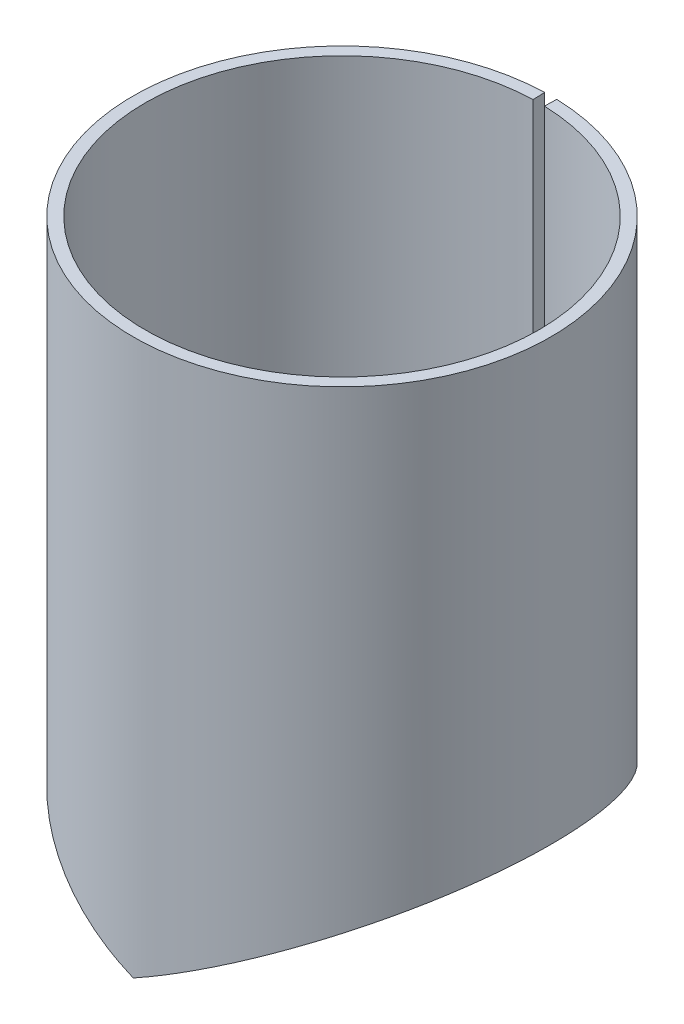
ISO-10303-21;
HEADER;
FILE_DESCRIPTION(('STEP AP214'),'2;1');
FILE_NAME('part.step','',(''),(''),'','','');
FILE_SCHEMA(('AUTOMOTIVE_DESIGN { 1 0 10303 214 1 1 1 1 }'));
ENDSEC;
DATA;
#1=APPLICATION_CONTEXT('core data for automotive mechanical design processes');
#2=APPLICATION_PROTOCOL_DEFINITION('international standard','automotive_design',2000,#1);
#3=PRODUCT_CONTEXT('',#1,'mechanical');
#4=PRODUCT('Part','Part','',(#3));
#5=PRODUCT_RELATED_PRODUCT_CATEGORY('part','',(#4));
#6=PRODUCT_DEFINITION_FORMATION('','',#4);
#7=PRODUCT_DEFINITION_CONTEXT('part definition',#1,'design');
#8=PRODUCT_DEFINITION('design','',#6,#7);
#9=PRODUCT_DEFINITION_SHAPE('','',#8);
#10=(LENGTH_UNIT() NAMED_UNIT(*) SI_UNIT(.MILLI.,.METRE.));
#11=(NAMED_UNIT(*) PLANE_ANGLE_UNIT() SI_UNIT($,.RADIAN.));
#12=(NAMED_UNIT(*) SI_UNIT($,.STERADIAN.) SOLID_ANGLE_UNIT());
#13=UNCERTAINTY_MEASURE_WITH_UNIT(LENGTH_MEASURE(1.E-05),#10,'distance_accuracy_value','');
#14=(GEOMETRIC_REPRESENTATION_CONTEXT(3) GLOBAL_UNCERTAINTY_ASSIGNED_CONTEXT((#13)) GLOBAL_UNIT_ASSIGNED_CONTEXT((#10,
#11,#12)) REPRESENTATION_CONTEXT('',''));
#15=CARTESIAN_POINT('',(0.,0.,0.));
#16=DIRECTION('',(0.,0.,1.));
#17=DIRECTION('',(1.,0.,0.));
#18=AXIS2_PLACEMENT_3D('',#15,#16,#17);
#19=CARTESIAN_POINT('',(0.,46.170395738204,0.));
#20=DIRECTION('',(0.,-1.,0.));
#21=DIRECTION('',(0.,0.,-1.));
#22=AXIS2_PLACEMENT_3D('',#19,#20,#21);
#23=PLANE('',#22);
#24=DIRECTION('',(0.0287967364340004,0.,-0.999585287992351));
#25=VECTOR('',#24,1.);
#26=CARTESIAN_POINT('',(0.471203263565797,46.170395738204,-16.3562926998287));
#27=LINE('',#26,#25);
#28=CARTESIAN_POINT('',(0.471203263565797,46.170395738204,-16.3562926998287));
#29=VERTEX_POINT('',#28);
#30=CARTESIAN_POINT('',(0.499999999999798,46.170395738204,-17.3558779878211));
#31=VERTEX_POINT('',#30);
#32=EDGE_CURVE('E13',#29,#31,#27,.T.);
#33=ORIENTED_EDGE('',*,*,#32,.F.);
#34=CARTESIAN_POINT('',(0.,46.170395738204,0.));
#35=DIRECTION('',(0.,1.,0.));
#36=DIRECTION('',(0.,0.,1.));
#37=AXIS2_PLACEMENT_3D('',#34,#35,#36);
#38=CIRCLE('',#37,16.3630786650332);
#39=CARTESIAN_POINT('',(-0.471203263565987,46.170395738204,-16.3562926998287));
#40=VERTEX_POINT('',#39);
#41=EDGE_CURVE('E85',#40,#29,#38,.T.);
#42=ORIENTED_EDGE('',*,*,#41,.F.);
#43=DIRECTION('',(-0.0287967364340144,0.,-0.99958528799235));
#44=VECTOR('',#43,1.);
#45=CARTESIAN_POINT('',(-0.471203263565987,46.170395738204,-16.3562926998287));
#46=LINE('',#45,#44);
#47=CARTESIAN_POINT('',(-0.500000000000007,46.170395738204,-17.3558779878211));
#48=VERTEX_POINT('',#47);
#49=EDGE_CURVE('E50',#40,#48,#46,.T.);
#50=ORIENTED_EDGE('',*,*,#49,.T.);
#51=CARTESIAN_POINT('',(0.,46.170395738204,0.));
#52=DIRECTION('',(0.,-1.,0.));
#53=DIRECTION('',(0.,0.,-1.));
#54=AXIS2_PLACEMENT_3D('',#51,#52,#53);
#55=CIRCLE('',#54,17.3630786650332);
#56=EDGE_CURVE('E87',#48,#31,#55,.F.);
#57=ORIENTED_EDGE('',*,*,#56,.T.);
#58=EDGE_LOOP('',(#33,#42,#50,#57));
#59=FACE_BOUND('',#58,.T.);
#60=ADVANCED_FACE('F38',(#59),#23,.F.);
#61=CARTESIAN_POINT('',(-0.471203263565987,23.1887512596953,-16.3562926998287));
#62=DIRECTION('',(-0.99958528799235,0.,0.0287967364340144));
#63=DIRECTION('',(0.,1.,0.));
#64=AXIS2_PLACEMENT_3D('',#61,#62,#63);
#65=PLANE('',#64);
#66=ORIENTED_EDGE('',*,*,#49,.F.);
#67=DIRECTION('',(0.,1.,0.));
#68=VECTOR('',#67,1.);
#69=CARTESIAN_POINT('',(-0.471203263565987,0.207106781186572,-16.3562926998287));
#70=LINE('',#69,#68);
#71=CARTESIAN_POINT('',(-0.471203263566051,0.207106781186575,-16.3562926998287));
#72=VERTEX_POINT('',#71);
#73=EDGE_CURVE('E95',#72,#40,#70,.T.);
#74=ORIENTED_EDGE('',*,*,#73,.F.);
#75=CARTESIAN_POINT('',(-0.500000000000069,0.207106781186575,-17.3558779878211));
#76=CARTESIAN_POINT('',(-0.471203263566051,0.207106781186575,-16.3562926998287));
#77=B_SPLINE_CURVE_WITH_KNOTS('',1,(#75,#76),.UNSPECIFIED.,.F.,.F.,(2,2),(0.,1.),.UNSPECIFIED.);
#78=CARTESIAN_POINT('',(-0.500000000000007,0.207106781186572,-17.3558779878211));
#79=VERTEX_POINT('',#78);
#80=EDGE_CURVE('E225',#72,#79,#77,.F.);
#81=ORIENTED_EDGE('',*,*,#80,.T.);
#82=DIRECTION('',(0.,-1.,0.));
#83=VECTOR('',#82,1.);
#84=CARTESIAN_POINT('',(-0.500000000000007,158.071576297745,-17.3558779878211));
#85=LINE('',#84,#83);
#86=EDGE_CURVE('E156',#79,#48,#85,.F.);
#87=ORIENTED_EDGE('',*,*,#86,.T.);
#88=EDGE_LOOP('',(#66,#74,#81,#87));
#89=FACE_BOUND('',#88,.T.);
#90=ADVANCED_FACE('F191',(#89),#65,.F.);
#91=CARTESIAN_POINT('',(0.,0.,17.3630786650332));
#92=CARTESIAN_POINT('',(-0.720070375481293,0.298257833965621,17.3630786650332));
#93=CARTESIAN_POINT('',(-1.34919888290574,0.558423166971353,17.3189918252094));
#94=CARTESIAN_POINT('',(-2.15401364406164,0.891830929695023,17.2310636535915));
#95=CARTESIAN_POINT('',(-2.3991975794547,0.993476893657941,17.1979910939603));
#96=CARTESIAN_POINT('',(-2.73256832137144,1.13171090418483,17.1470757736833));
#97=CARTESIAN_POINT('',(-2.83796063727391,1.17541641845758,17.129877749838));
#98=CARTESIAN_POINT('',(-2.98750014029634,1.2374159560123,17.1042071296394));
#99=CARTESIAN_POINT('',(-3.03592191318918,1.25748934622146,17.0956707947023));
#100=CARTESIAN_POINT('',(-3.10642418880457,1.28670974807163,17.0829505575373));
#101=CARTESIAN_POINT('',(-3.12956988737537,1.29630160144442,17.0787244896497));
#102=CARTESIAN_POINT('',(-3.16375671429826,1.31046696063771,17.0724127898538));
#103=CARTESIAN_POINT('',(-3.17506370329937,1.31515167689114,17.0703134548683));
#104=CARTESIAN_POINT('',(-3.19189136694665,1.32212314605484,17.0671720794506));
#105=CARTESIAN_POINT('',(-3.1974784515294,1.32443770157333,17.0661262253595));
#106=CARTESIAN_POINT('',(-3.20582588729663,1.32789563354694,17.0645594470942));
#107=CARTESIAN_POINT('',(-3.20860283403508,1.32904596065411,17.0640375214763));
#108=CARTESIAN_POINT('',(-3.21275995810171,1.33076797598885,17.0632551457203));
#109=CARTESIAN_POINT('',(-3.21414428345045,1.33134140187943,17.0629944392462));
#110=CARTESIAN_POINT('',(-3.21691016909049,1.33248709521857,17.0624731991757));
#111=CARTESIAN_POINT('',(-3.21737868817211,1.33268116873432,17.062384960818));
#112=CARTESIAN_POINT('',(-3.80673600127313,1.57680088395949,16.9511704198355));
#113=CARTESIAN_POINT('',(-4.36108421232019,1.80623967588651,16.8152310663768));
#114=CARTESIAN_POINT('',(-5.1423308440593,2.12980130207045,16.5863369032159));
#115=CARTESIAN_POINT('',(-5.39439005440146,2.23422241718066,16.5058613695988));
#116=CARTESIAN_POINT('',(-5.75997554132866,2.38570494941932,16.3803474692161));
#117=CARTESIAN_POINT('',(-5.87975460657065,2.43534093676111,16.33770846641));
#118=CARTESIAN_POINT('',(-6.05631232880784,2.50850763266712,16.2727230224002));
#119=CARTESIAN_POINT('',(-6.11464648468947,2.53268198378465,16.2508899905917));
#120=CARTESIAN_POINT('',(-6.2013722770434,2.56862168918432,16.2179048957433));
#121=CARTESIAN_POINT('',(-6.23015163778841,2.58054795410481,16.2068706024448));
#122=CARTESIAN_POINT('',(-6.27312712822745,2.59835689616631,16.1902628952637));
#123=CARTESIAN_POINT('',(-6.28742003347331,2.60427980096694,16.1847176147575));
#124=CARTESIAN_POINT('',(-6.30881104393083,2.6131440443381,16.1763859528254));
#125=CARTESIAN_POINT('',(-6.31593332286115,2.61609543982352,16.1736064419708));
#126=CARTESIAN_POINT('',(-6.3266046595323,2.62051750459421,16.1694337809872));
#127=CARTESIAN_POINT('',(-6.33015975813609,2.62199068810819,16.1680423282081));
#128=CARTESIAN_POINT('',(-6.337265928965,2.62493537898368,16.1652582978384));
#129=CARTESIAN_POINT('',(-6.3401518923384,2.626131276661,16.1641267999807));
#130=CARTESIAN_POINT('',(-6.88377960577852,2.85140126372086,15.9507328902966));
#131=CARTESIAN_POINT('',(-7.39808900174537,3.06434855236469,15.7176842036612));
#132=CARTESIAN_POINT('',(-8.13102396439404,3.36790485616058,15.3439940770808));
#133=CARTESIAN_POINT('',(-8.36892698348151,3.46644618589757,15.2154057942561));
#134=CARTESIAN_POINT('',(-8.71616619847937,3.61029202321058,15.0174132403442));
#135=CARTESIAN_POINT('',(-8.83031074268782,3.65757960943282,14.9505636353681));
#136=CARTESIAN_POINT('',(-8.99913041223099,3.7275194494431,14.8491232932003));
#137=CARTESIAN_POINT('',(-9.05500415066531,3.75066747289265,14.8151154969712));
#138=CARTESIAN_POINT('',(-9.13821658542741,3.78514162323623,14.7638260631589));
#139=CARTESIAN_POINT('',(-9.165854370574,3.79659169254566,14.7466832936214));
#140=CARTESIAN_POINT('',(-9.20716166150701,3.81370482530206,14.7209014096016));
#141=CARTESIAN_POINT('',(-9.2209058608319,3.81939887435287,14.7122961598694));
#142=CARTESIAN_POINT('',(-9.24148483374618,3.82792445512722,14.6993715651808));
#143=CARTESIAN_POINT('',(-9.24833827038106,3.83076373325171,14.6950605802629));
#144=CARTESIAN_POINT('',(-9.26203270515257,3.83643712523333,14.686433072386));
#145=CARTESIAN_POINT('',(-9.26807038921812,3.8389384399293,14.6826242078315));
#146=CARTESIAN_POINT('',(-9.76454654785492,4.04461994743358,14.3688735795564));
#147=CARTESIAN_POINT('',(-10.2286957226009,4.236805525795,14.0413662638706));
#148=CARTESIAN_POINT('',(-10.8873022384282,4.50958649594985,13.5285095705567));
#149=CARTESIAN_POINT('',(-11.1005776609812,4.59793058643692,13.3539543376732));
#150=CARTESIAN_POINT('',(-11.4111072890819,4.7265723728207,13.0874648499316));
#151=CARTESIAN_POINT('',(-11.5130537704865,4.76880724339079,12.9978586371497));
#152=CARTESIAN_POINT('',(-11.6636337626,4.83119096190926,12.8623756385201));
#153=CARTESIAN_POINT('',(-11.7134371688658,4.85182410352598,12.8170356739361));
#154=CARTESIAN_POINT('',(-11.7875583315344,4.88253166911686,12.7487684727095));
#155=CARTESIAN_POINT('',(-11.8121680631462,4.89272716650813,12.7259698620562));
#156=CARTESIAN_POINT('',(-11.848936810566,4.90795987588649,12.6917090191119));
#157=CARTESIAN_POINT('',(-11.8611687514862,4.91302735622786,12.680278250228));
#158=CARTESIAN_POINT('',(-11.8794802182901,4.92061344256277,12.6631165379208));
#159=CARTESIAN_POINT('',(-11.885577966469,4.92313961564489,12.6573933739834));
#160=CARTESIAN_POINT('',(-11.8977613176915,4.9281869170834,12.6459418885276));
#161=CARTESIAN_POINT('',(-11.9031375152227,4.93041415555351,12.6408822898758));
#162=CARTESIAN_POINT('',(-12.7789104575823,5.29322612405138,11.8153327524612));
#163=CARTESIAN_POINT('',(-13.5435053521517,5.60923919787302,10.924856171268));
#164=CARTESIAN_POINT('',(-14.5286181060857,6.01727921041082,9.52477749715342));
#165=CARTESIAN_POINT('',(-14.8301423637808,6.14229594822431,9.04732450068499));
#166=CARTESIAN_POINT('',(-15.2424608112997,6.31332615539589,8.31994980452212));
#167=CARTESIAN_POINT('',(-15.3732450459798,6.36758707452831,8.07562257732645));
#168=CARTESIAN_POINT('',(-15.5595277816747,6.44485472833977,7.70691615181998));
#169=CARTESIAN_POINT('',(-15.6199734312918,6.4699233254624,7.58364452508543));
#170=CARTESIAN_POINT('',(-15.7081831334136,6.50649528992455,7.39825430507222));
#171=CARTESIAN_POINT('',(-15.7371765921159,6.51851412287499,7.33637708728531));
#172=CARTESIAN_POINT('',(-15.7800540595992,6.53628463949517,7.24344934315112));
#173=CARTESIAN_POINT('',(-15.7942444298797,6.54216518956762,7.21245477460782));
#174=CARTESIAN_POINT('',(-15.8153770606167,6.55092158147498,7.16593603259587));
#175=CARTESIAN_POINT('',(-15.8223957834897,6.55382963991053,7.15042530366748));
#176=CARTESIAN_POINT('',(-15.8328856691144,6.55817561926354,7.12715262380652));
#177=CARTESIAN_POINT('',(-15.836375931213,6.55962159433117,7.11939396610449));
#178=CARTESIAN_POINT('',(-15.8433437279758,6.56250817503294,7.10387447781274));
#179=CARTESIAN_POINT('',(-15.8465005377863,6.5638159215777,7.09683082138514));
#180=CARTESIAN_POINT('',(-16.3356554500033,6.76644654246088,6.00302951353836));
#181=CARTESIAN_POINT('',(-16.7055269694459,6.91912199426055,4.875869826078));
#182=CARTESIAN_POINT('',(-17.0831860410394,7.07555858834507,3.15979662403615));
#183=CARTESIAN_POINT('',(-17.179632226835,7.11560802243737,2.5835432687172));
#184=CARTESIAN_POINT('',(-17.2803828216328,7.15753802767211,1.71737005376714));
#185=CARTESIAN_POINT('',(-17.3066514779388,7.16849067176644,1.42834553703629));
#186=CARTESIAN_POINT('',(-17.3446566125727,7.18434791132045,0.850437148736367));
#187=CARTESIAN_POINT('',(-17.3563779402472,7.18924621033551,0.562519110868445));
#188=CARTESIAN_POINT('',(-17.3791418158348,7.1986805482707,-0.884559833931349));
#189=CARTESIAN_POINT('',(-17.2812793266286,7.15762961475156,-2.05164415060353));
#190=CARTESIAN_POINT('',(-16.9566409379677,7.02315560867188,-3.78056455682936));
#191=CARTESIAN_POINT('',(-16.8188622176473,6.96618133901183,-4.35322997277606));
#192=CARTESIAN_POINT('',(-16.568081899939,6.86249553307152,-5.20213629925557));
#193=CARTESIAN_POINT('',(-16.4771414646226,6.82489619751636,-5.48342241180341));
#194=CARTESIAN_POINT('',(-16.3297859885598,6.76394109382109,-5.90224475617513));
#195=CARTESIAN_POINT('',(-16.2788436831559,6.74286337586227,-6.04133438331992));
#196=CARTESIAN_POINT('',(-16.1997068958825,6.71010777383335,-6.2491191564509));
#197=CARTESIAN_POINT('',(-16.1728740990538,6.69899940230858,-6.31823913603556));
#198=CARTESIAN_POINT('',(-16.1319458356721,6.6820520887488,-6.42169757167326));
#199=CARTESIAN_POINT('',(-16.1181899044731,6.67635552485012,-6.45614679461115));
#200=CARTESIAN_POINT('',(-16.0973864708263,6.6677394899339,-6.50776410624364));
#201=CARTESIAN_POINT('',(-16.0904237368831,6.66485561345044,-6.52496045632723));
#202=CARTESIAN_POINT('',(-16.0799372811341,6.66051200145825,-6.55074070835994));
#203=CARTESIAN_POINT('',(-16.0764347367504,6.659061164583,-6.55933174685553));
#204=CARTESIAN_POINT('',(-16.0694155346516,6.65615355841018,-6.5765090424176));
#205=CARTESIAN_POINT('',(-16.0656217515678,6.65458198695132,-6.58577038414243));
#206=CARTESIAN_POINT('',(-15.6468120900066,6.48108558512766,-7.60600169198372));
#207=CARTESIAN_POINT('',(-15.1256251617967,6.26457399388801,-8.60238673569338));
#208=CARTESIAN_POINT('',(-14.1809145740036,5.87326642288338,-10.035209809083));
#209=CARTESIAN_POINT('',(-13.838941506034,5.73174053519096,-10.5024705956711));
#210=CARTESIAN_POINT('',(-13.2856796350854,5.50281665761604,-11.1826937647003));
#211=CARTESIAN_POINT('',(-13.0945484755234,5.42373619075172,-11.4059876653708));
#212=CARTESIAN_POINT('',(-12.7978850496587,5.30095672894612,-11.7350949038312));
#213=CARTESIAN_POINT('',(-12.6973365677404,5.25933711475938,-11.8438249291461));
#214=CARTESIAN_POINT('',(-12.5440392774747,5.19586800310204,-12.0053775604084));
#215=CARTESIAN_POINT('',(-12.4925277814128,5.17453835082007,-12.0589713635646));
#216=CARTESIAN_POINT('',(-12.4146442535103,5.14228394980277,-12.1389659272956));
#217=CARTESIAN_POINT('',(-12.3885803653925,5.13148916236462,-12.1655647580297));
#218=CARTESIAN_POINT('',(-12.3493307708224,5.11523200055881,-12.2053626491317));
#219=CARTESIAN_POINT('',(-12.3362219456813,5.10980211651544,-12.2186118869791));
#220=CARTESIAN_POINT('',(-12.3165203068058,5.10164104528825,-12.238460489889));
#221=CARTESIAN_POINT('',(-12.3099466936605,5.09891798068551,-12.2450724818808));
#222=CARTESIAN_POINT('',(-12.2967866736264,5.09346643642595,-12.2582880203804));
#223=CARTESIAN_POINT('',(-12.2895334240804,5.09046170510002,-12.2655590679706));
#224=CARTESIAN_POINT('',(-11.9043461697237,4.93089089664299,-12.6511266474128));
#225=CARTESIAN_POINT('',(-11.4999341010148,4.7633239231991,-13.0207235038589));
#226=CARTESIAN_POINT('',(-10.8552593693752,4.49629681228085,-13.554248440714));
#227=CARTESIAN_POINT('',(-10.6340326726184,4.40467500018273,-13.7286069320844));
#228=CARTESIAN_POINT('',(-10.292722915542,4.26332311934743,-13.9841537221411));
#229=CARTESIAN_POINT('',(-10.1773752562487,4.2155526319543,-14.0683372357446));
#230=CARTESIAN_POINT('',(-10.0019963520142,4.1429171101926,-14.193016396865));
#231=CARTESIAN_POINT('',(-9.94314385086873,4.11854197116,-14.2343100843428));
#232=CARTESIAN_POINT('',(-9.85427727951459,4.08173431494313,-14.2958391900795));
#233=CARTESIAN_POINT('',(-9.82455712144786,4.06942427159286,-14.3162803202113));
#234=CARTESIAN_POINT('',(-9.77983013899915,4.05089796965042,-14.34683760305));
#235=CARTESIAN_POINT('',(-9.76489668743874,4.04471232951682,-14.3570059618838));
#236=CARTESIAN_POINT('',(-9.74245985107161,4.0354185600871,-14.3722322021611));
#237=CARTESIAN_POINT('',(-9.73497479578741,4.03231808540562,-14.3773032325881));
#238=CARTESIAN_POINT('',(-9.71999247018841,4.02611203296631,-14.3874364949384));
#239=CARTESIAN_POINT('',(-9.71172587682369,4.02268777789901,-14.3930173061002));
#240=CARTESIAN_POINT('',(-9.27401246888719,3.84137339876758,-14.6880677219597));
#241=CARTESIAN_POINT('',(-8.81756809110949,3.65227205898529,-14.9675994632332));
#242=CARTESIAN_POINT('',(-8.09440273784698,3.35275543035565,-15.3633542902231));
#243=CARTESIAN_POINT('',(-7.84694096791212,3.2502724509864,-15.4913421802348));
#244=CARTESIAN_POINT('',(-7.46619765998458,3.09258182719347,-15.6764890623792));
#245=CARTESIAN_POINT('',(-7.33769216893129,3.03935726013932,-15.7370651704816));
#246=CARTESIAN_POINT('',(-7.14256152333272,2.95852887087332,-15.8260995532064));
#247=CARTESIAN_POINT('',(-7.07712262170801,2.93142081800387,-15.8554726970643));
#248=CARTESIAN_POINT('',(-6.97837345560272,2.89051085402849,-15.8990596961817));
#249=CARTESIAN_POINT('',(-6.94535860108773,2.87683288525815,-15.9135099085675));
#250=CARTESIAN_POINT('',(-6.89568892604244,2.85625396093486,-15.9350651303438));
#251=CARTESIAN_POINT('',(-6.87910780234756,2.84938399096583,-15.9422301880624));
#252=CARTESIAN_POINT('',(-6.85419930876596,2.83906354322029,-15.9529475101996));
#253=CARTESIAN_POINT('',(-6.8458903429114,2.83562081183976,-15.9565149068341));
#254=CARTESIAN_POINT('',(-6.83341769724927,2.83045284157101,-15.9618584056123));
#255=CARTESIAN_POINT('',(-6.82925861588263,2.82872953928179,-15.9636383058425));
#256=CARTESIAN_POINT('',(-6.82093738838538,2.8252816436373,-15.9671955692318));
#257=CARTESIAN_POINT('',(-6.81616290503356,2.82330332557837,-15.9692341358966));
#258=CARTESIAN_POINT('',(-6.35803993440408,2.63347799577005,-16.164654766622));
#259=CARTESIAN_POINT('',(-5.87246615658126,2.43225258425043,-16.3488828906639));
#260=CARTESIAN_POINT('',(-5.09704741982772,2.11110707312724,-16.6003144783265));
#261=CARTESIAN_POINT('',(-4.83074592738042,2.00084067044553,-16.6799600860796));
#262=CARTESIAN_POINT('',(-4.41963153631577,1.83061421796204,-16.791769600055));
#263=CARTESIAN_POINT('',(-4.28065086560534,1.7730675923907,-16.8277622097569));
#264=CARTESIAN_POINT('',(-4.06928716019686,1.68554094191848,-16.8796524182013));
#265=CARTESIAN_POINT('',(-3.99835055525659,1.65616427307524,-16.8965993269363));
#266=CARTESIAN_POINT('',(-3.89122597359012,1.61179759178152,-16.9214717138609));
#267=CARTESIAN_POINT('',(-3.85539783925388,1.59695841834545,-16.9296711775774));
#268=CARTESIAN_POINT('',(-3.80147619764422,1.57462423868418,-16.9418304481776));
#269=CARTESIAN_POINT('',(-3.78347241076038,1.56716694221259,-16.9458602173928));
#270=CARTESIAN_POINT('',(-3.75642193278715,1.55596214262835,-16.951869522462));
#271=CARTESIAN_POINT('',(-3.74739764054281,1.55222406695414,-16.9538667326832));
#272=CARTESIAN_POINT('',(-3.73385001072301,1.54661223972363,-16.9568536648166));
#273=CARTESIAN_POINT('',(-3.72933226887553,1.54474084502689,-16.9578478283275));
#274=CARTESIAN_POINT('',(-3.72255285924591,1.54193257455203,-16.9593368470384));
#275=CARTESIAN_POINT('',(-3.72029258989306,1.54099628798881,-16.9598328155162));
#276=CARTESIAN_POINT('',(-3.71577111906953,1.53912332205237,-16.960824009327));
#277=CARTESIAN_POINT('',(-3.71278124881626,1.53788479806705,-16.9614786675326));
#278=CARTESIAN_POINT('',(-3.31880059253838,1.37468178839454,-17.0476817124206));
#279=CARTESIAN_POINT('',(-2.85569517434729,1.18255255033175,-17.1351426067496));
#280=CARTESIAN_POINT('',(-1.78537227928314,0.739171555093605,-17.2794835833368));
#281=CARTESIAN_POINT('',(-1.17811541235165,0.487968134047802,-17.3363423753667));
#282=CARTESIAN_POINT('',(-0.500000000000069,0.207106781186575,-17.3558779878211));
#283=CARTESIAN_POINT('',(0.,0.,16.3630786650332));
#284=CARTESIAN_POINT('',(-0.678596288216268,0.29825663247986,16.3630786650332));
#285=CARTESIAN_POINT('',(-1.27149383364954,0.558423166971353,16.3215309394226));
#286=CARTESIAN_POINT('',(-2.02995651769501,0.891830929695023,16.2386668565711));
#287=CARTESIAN_POINT('',(-2.26101945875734,0.993476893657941,16.2074990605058));
#288=CARTESIAN_POINT('',(-2.5751902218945,1.13171090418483,16.1595161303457));
#289=CARTESIAN_POINT('',(-2.67451262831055,1.17541641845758,16.1433086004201));
#290=CARTESIAN_POINT('',(-2.81543963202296,1.2374159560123,16.1191164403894));
#291=CARTESIAN_POINT('',(-2.86107262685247,1.25748934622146,16.1110717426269));
#292=CARTESIAN_POINT('',(-2.92751443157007,1.28670974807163,16.0990841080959));
#293=CARTESIAN_POINT('',(-2.94932708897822,1.29630160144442,16.0951014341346));
#294=CARTESIAN_POINT('',(-2.98154497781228,1.31046696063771,16.0891532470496));
#295=CARTESIAN_POINT('',(-2.99220075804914,1.31515167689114,16.0871748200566));
#296=CARTESIAN_POINT('',(-3.00805925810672,1.32212314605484,16.0842143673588));
#297=CARTESIAN_POINT('',(-3.01332456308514,1.32443770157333,16.083228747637));
#298=CARTESIAN_POINT('',(-3.02119124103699,1.32789563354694,16.0817522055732));
#299=CARTESIAN_POINT('',(-3.0238082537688,1.32904596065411,16.0812603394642));
#300=CARTESIAN_POINT('',(-3.0277259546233,1.33076797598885,16.080523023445));
#301=CARTESIAN_POINT('',(-3.02903055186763,1.33134140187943,16.0802773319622));
#302=CARTESIAN_POINT('',(-3.03163714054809,1.33248709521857,16.0797861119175));
#303=CARTESIAN_POINT('',(-3.0320786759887,1.33268116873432,16.0797029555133));
#304=CARTESIAN_POINT('',(-3.58749285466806,1.57680088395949,15.9748936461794));
#305=CARTESIAN_POINT('',(-4.10991422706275,1.80623967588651,15.8467835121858));
#306=CARTESIAN_POINT('',(-4.84616615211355,2.12980130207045,15.6310721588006));
#307=CARTESIAN_POINT('',(-5.08370839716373,2.23422241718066,15.5552314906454));
#308=CARTESIAN_POINT('',(-5.42823854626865,2.38570494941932,15.4369463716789));
#309=CARTESIAN_POINT('',(-5.54111911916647,2.43534093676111,15.3967630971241));
#310=CARTESIAN_POINT('',(-5.70750826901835,2.50850763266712,15.3355203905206));
#311=CARTESIAN_POINT('',(-5.76248275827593,2.53268198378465,15.3149447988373));
#312=CARTESIAN_POINT('',(-5.84421371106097,2.56862168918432,15.2838594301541));
#313=CARTESIAN_POINT('',(-5.87133556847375,2.58054795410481,15.2734606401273));
#314=CARTESIAN_POINT('',(-5.9118359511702,2.59835689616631,15.2578094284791));
#315=CARTESIAN_POINT('',(-5.92530567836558,2.60427980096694,15.2525835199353));
#316=CARTESIAN_POINT('',(-5.94546470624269,2.6131440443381,15.2447317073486));
#317=CARTESIAN_POINT('',(-5.95217678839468,2.61609543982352,15.242112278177));
#318=CARTESIAN_POINT('',(-5.9622335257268,2.62051750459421,15.2381799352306));
#319=CARTESIAN_POINT('',(-5.96558387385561,2.62199068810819,15.2368686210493));
#320=CARTESIAN_POINT('',(-5.97228077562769,2.62493537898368,15.2342449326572));
#321=CARTESIAN_POINT('',(-5.97500052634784,2.626131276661,15.2331786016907));
#322=CARTESIAN_POINT('',(-6.48731883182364,2.85140126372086,15.0320747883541));
#323=CARTESIAN_POINT('',(-6.9720073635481,3.06434855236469,14.8124481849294));
#324=CARTESIAN_POINT('',(-7.66273005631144,3.36790485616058,14.4602801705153));
#325=CARTESIAN_POINT('',(-7.88693141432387,3.46644618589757,14.3390977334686));
#326=CARTESIAN_POINT('',(-8.21417191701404,3.61029202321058,14.1525082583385));
#327=CARTESIAN_POINT('',(-8.32174248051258,3.65757960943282,14.0895087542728));
#328=CARTESIAN_POINT('',(-8.48083923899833,3.7275194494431,13.9939107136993));
#329=CARTESIAN_POINT('',(-8.5334950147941,3.75066747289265,13.9618615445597));
#330=CARTESIAN_POINT('',(-8.61191495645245,3.78514162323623,13.9135260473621));
#331=CARTESIAN_POINT('',(-8.63796098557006,3.79659169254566,13.8973705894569));
#332=CARTESIAN_POINT('',(-8.67688924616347,3.81370482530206,13.8730735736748));
#333=CARTESIAN_POINT('',(-8.68984186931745,3.81939887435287,13.8649639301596));
#334=CARTESIAN_POINT('',(-8.70923562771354,3.82792445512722,13.8527837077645));
#335=CARTESIAN_POINT('',(-8.71569435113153,3.83076373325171,13.8487210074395));
#336=CARTESIAN_POINT('',(-8.72860007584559,3.83643712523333,13.8405903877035));
#337=CARTESIAN_POINT('',(-8.73429002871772,3.8389384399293,13.8370008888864));
#338=CARTESIAN_POINT('',(-9.20217240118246,4.04461994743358,13.5413202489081));
#339=CARTESIAN_POINT('',(-9.63958961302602,4.236805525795,13.2326752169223));
#340=CARTESIAN_POINT('',(-10.2602646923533,4.50958649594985,12.74935572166));
#341=CARTESIAN_POINT('',(-10.461256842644,4.59793058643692,12.5848537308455));
#342=CARTESIAN_POINT('',(-10.753901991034,4.7265723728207,12.3337122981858));
#343=CARTESIAN_POINT('',(-10.8499770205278,4.76880724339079,12.2492668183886));
#344=CARTESIAN_POINT('',(-10.9918845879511,4.83119096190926,12.1215867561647));
#345=CARTESIAN_POINT('',(-11.0388196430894,4.85182410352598,12.0788580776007));
#346=CARTESIAN_POINT('',(-11.1086719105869,4.88253166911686,12.0145226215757));
#347=CARTESIAN_POINT('',(-11.1318642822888,4.89272716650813,11.9930370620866));
#348=CARTESIAN_POINT('',(-11.1665153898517,4.90795987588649,11.9607494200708));
#349=CARTESIAN_POINT('',(-11.1780428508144,4.91302735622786,11.9499769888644));
#350=CARTESIAN_POINT('',(-11.1952996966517,4.92061344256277,11.9338036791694));
#351=CARTESIAN_POINT('',(-11.2010462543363,4.92313961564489,11.928410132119));
#352=CARTESIAN_POINT('',(-11.2125279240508,4.9281869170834,11.91761817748));
#353=CARTESIAN_POINT('',(-11.2175944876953,4.93041415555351,11.9128499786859));
#354=CARTESIAN_POINT('',(-12.0429286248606,5.29322612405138,11.1348467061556));
#355=CARTESIAN_POINT('',(-12.7634878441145,5.60923919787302,10.295655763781));
#356=CARTESIAN_POINT('',(-13.691864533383,6.01727921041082,8.97621248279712));
#357=CARTESIAN_POINT('',(-13.9760229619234,6.14229594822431,8.52625766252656));
#358=CARTESIAN_POINT('',(-14.3645945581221,6.31332615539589,7.84077500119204));
#359=CARTESIAN_POINT('',(-14.4878464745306,6.36758707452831,7.61051942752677));
#360=CARTESIAN_POINT('',(-14.6634005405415,6.44485472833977,7.26304808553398));
#361=CARTESIAN_POINT('',(-14.7203649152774,6.4699233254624,7.14687609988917));
#362=CARTESIAN_POINT('',(-14.8034943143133,6.50649528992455,6.97216314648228));
#363=CARTESIAN_POINT('',(-14.8308179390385,6.51851412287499,6.91384965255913));
#364=CARTESIAN_POINT('',(-14.8712259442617,6.53628463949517,6.82627393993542));
#365=CARTESIAN_POINT('',(-14.8845990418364,6.54216518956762,6.79706445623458));
#366=CARTESIAN_POINT('',(-14.9045145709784,6.55092158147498,6.75322489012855));
#367=CARTESIAN_POINT('',(-14.9111290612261,6.55382963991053,6.73860747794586));
#368=CARTESIAN_POINT('',(-14.9210147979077,6.55817561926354,6.71667515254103));
#369=CARTESIAN_POINT('',(-14.9243040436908,6.55962159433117,6.70936334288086));
#370=CARTESIAN_POINT('',(-14.9308705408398,6.56250817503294,6.69473767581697));
#371=CARTESIAN_POINT('',(-14.9338455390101,6.5638159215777,6.68809968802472));
#372=CARTESIAN_POINT('',(-15.3948283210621,6.76644654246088,5.65729419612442));
#373=CARTESIAN_POINT('',(-15.743397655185,6.91912199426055,4.59505154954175));
#374=CARTESIAN_POINT('',(-16.0993060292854,7.07555858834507,2.97781296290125));
#375=CARTESIAN_POINT('',(-16.1901975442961,7.11560802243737,2.43474803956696));
#376=CARTESIAN_POINT('',(-16.285145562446,7.15753802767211,1.61846074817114));
#377=CARTESIAN_POINT('',(-16.3099013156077,7.16849067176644,1.34608215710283));
#378=CARTESIAN_POINT('',(-16.3457176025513,7.18434791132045,0.801457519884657));
#379=CARTESIAN_POINT('',(-16.3567638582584,7.18924621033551,0.530121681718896));
#380=CARTESIAN_POINT('',(-16.3782166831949,7.1986805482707,-0.833614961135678));
#381=CARTESIAN_POINT('',(-16.2859904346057,7.15762961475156,-1.9334828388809));
#382=CARTESIAN_POINT('',(-15.980049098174,7.02315560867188,-3.56282871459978));
#383=CARTESIAN_POINT('',(-15.8502055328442,6.96618133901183,-4.10251234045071));
#384=CARTESIAN_POINT('',(-15.6138685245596,6.86249553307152,-4.90252720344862));
#385=CARTESIAN_POINT('',(-15.5281656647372,6.82489619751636,-5.16761307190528));
#386=CARTESIAN_POINT('',(-15.389296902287,6.76394109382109,-5.5623139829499));
#387=CARTESIAN_POINT('',(-15.3412885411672,6.74286337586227,-5.6933929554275));
#388=CARTESIAN_POINT('',(-15.2667095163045,6.71010777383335,-5.88921068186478));
#389=CARTESIAN_POINT('',(-15.2414221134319,6.69899940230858,-5.95434980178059));
#390=CARTESIAN_POINT('',(-15.2028510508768,6.6820520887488,-6.05184970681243));
#391=CARTESIAN_POINT('',(-15.1898873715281,6.67635552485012,-6.08431487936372));
#392=CARTESIAN_POINT('',(-15.1702820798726,6.6677394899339,-6.13295937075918));
#393=CARTESIAN_POINT('',(-15.1637203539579,6.66485561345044,-6.1491653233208));
#394=CARTESIAN_POINT('',(-15.1538378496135,6.66051200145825,-6.17346080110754));
#395=CARTESIAN_POINT('',(-15.1505370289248,6.659061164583,-6.18155705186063));
#396=CARTESIAN_POINT('',(-15.1439220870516,6.65615355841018,-6.19774504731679));
#397=CARTESIAN_POINT('',(-15.1403468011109,6.65458198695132,-6.20647299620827));
#398=CARTESIAN_POINT('',(-14.7456578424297,6.48108558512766,-7.16794563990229));
#399=CARTESIAN_POINT('',(-14.2544878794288,6.26457399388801,-8.10694540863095));
#400=CARTESIAN_POINT('',(-13.3641864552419,5.87326642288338,-9.45724722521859));
#401=CARTESIAN_POINT('',(-13.041908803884,5.73174053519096,-9.89759684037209));
#402=CARTESIAN_POINT('',(-12.5205112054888,5.50281665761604,-10.5386435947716));
#403=CARTESIAN_POINT('',(-12.3403879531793,5.42373619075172,-10.7490772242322));
#404=CARTESIAN_POINT('',(-12.0608104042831,5.30095672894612,-11.0592300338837));
#405=CARTESIAN_POINT('',(-11.96605285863,5.25933711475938,-11.1616979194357));
#406=CARTESIAN_POINT('',(-11.821584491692,5.19586800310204,-11.3139461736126));
#407=CARTESIAN_POINT('',(-11.7730397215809,5.17453835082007,-11.3644533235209));
#408=CARTESIAN_POINT('',(-11.6996417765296,5.14228394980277,-11.439840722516));
#409=CARTESIAN_POINT('',(-11.6750789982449,5.13148916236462,-11.4649076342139));
#410=CARTESIAN_POINT('',(-11.6380899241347,5.11523200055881,-11.5024134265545));
#411=CARTESIAN_POINT('',(-11.6257360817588,5.10980211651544,-11.5148995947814));
#412=CARTESIAN_POINT('',(-11.6071691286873,5.10164104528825,-11.5336050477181));
#413=CARTESIAN_POINT('',(-11.6009741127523,5.09891798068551,-11.5398362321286));
#414=CARTESIAN_POINT('',(-11.588572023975,5.09346643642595,-11.5522906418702));
#415=CARTESIAN_POINT('',(-11.5817365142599,5.09046170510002,-11.5591429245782));
#416=CARTESIAN_POINT('',(-11.2187335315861,4.93089089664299,-11.9225043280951));
#417=CARTESIAN_POINT('',(-10.8376129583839,4.7633239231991,-12.2708148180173));
#418=CARTESIAN_POINT('',(-10.2300672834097,4.49629681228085,-12.7736122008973));
#419=CARTESIAN_POINT('',(-10.0215818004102,4.40467500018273,-12.9379287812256));
#420=CARTESIAN_POINT('',(-9.69992925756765,4.26332311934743,-13.1787577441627));
#421=CARTESIAN_POINT('',(-9.5912248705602,4.2155526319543,-13.2580928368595));
#422=CARTESIAN_POINT('',(-9.42594664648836,4.1429171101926,-13.3755912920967));
#423=CARTESIAN_POINT('',(-9.37048366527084,4.11854197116,-13.4145067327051));
#424=CARTESIAN_POINT('',(-9.28673522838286,4.08173431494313,-13.47249216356));
#425=CARTESIAN_POINT('',(-9.25872675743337,4.06942427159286,-13.4917560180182));
#426=CARTESIAN_POINT('',(-9.21657575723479,4.05089796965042,-13.5205534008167));
#427=CARTESIAN_POINT('',(-9.20250237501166,4.04471232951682,-13.5301361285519));
#428=CARTESIAN_POINT('',(-9.18135775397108,4.0354185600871,-13.544485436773));
#429=CARTESIAN_POINT('',(-9.17430378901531,4.03231808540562,-13.5492644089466));
#430=CARTESIAN_POINT('',(-9.16018434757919,4.02611203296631,-13.5588140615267));
#431=CARTESIAN_POINT('',(-9.15239385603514,4.02268777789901,-13.5640734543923));
#432=CARTESIAN_POINT('',(-8.7398898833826,3.84137339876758,-13.8421308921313));
#433=CARTESIAN_POINT('',(-8.3097337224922,3.65227205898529,-14.105563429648));
#434=CARTESIAN_POINT('',(-7.62821797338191,3.35275543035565,-14.4785253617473));
#435=CARTESIAN_POINT('',(-7.39500838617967,3.2502724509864,-14.5991419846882));
#436=CARTESIAN_POINT('',(-7.03619340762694,3.09258182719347,-14.7736256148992));
#437=CARTESIAN_POINT('',(-6.91508899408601,3.03935726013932,-14.8307129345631));
#438=CARTESIAN_POINT('',(-6.73119660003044,2.95852887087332,-14.9146195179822));
#439=CARTESIAN_POINT('',(-6.66952655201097,2.93142081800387,-14.9423009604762));
#440=CARTESIAN_POINT('',(-6.5764646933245,2.89051085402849,-14.9833776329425));
#441=CARTESIAN_POINT('',(-6.54535127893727,2.87683288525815,-14.9969956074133));
#442=CARTESIAN_POINT('',(-6.49854225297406,2.85625396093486,-15.0173093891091));
#443=CARTESIAN_POINT('',(-6.48291609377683,2.84938399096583,-15.0240617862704));
#444=CARTESIAN_POINT('',(-6.4594421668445,2.83906354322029,-15.0341618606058));
#445=CARTESIAN_POINT('',(-6.45161174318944,2.83562081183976,-15.0375237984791));
#446=CARTESIAN_POINT('',(-6.43985744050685,2.83045284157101,-15.0425595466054));
#447=CARTESIAN_POINT('',(-6.43593789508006,2.82872953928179,-15.0442369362));
#448=CARTESIAN_POINT('',(-6.4280959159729,2.8252816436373,-15.0475893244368));
#449=CARTESIAN_POINT('',(-6.42359641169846,2.82330332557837,-15.0495104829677));
#450=CARTESIAN_POINT('',(-5.99185833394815,2.63347799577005,-15.2336761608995));
#451=CARTESIAN_POINT('',(-5.5342504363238,2.43225258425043,-15.4072939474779));
#452=CARTESIAN_POINT('',(-4.80349075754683,2.11110707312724,-15.6442447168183));
#453=CARTESIAN_POINT('',(-4.5525264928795,2.00084067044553,-15.7193032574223));
#454=CARTESIAN_POINT('',(-4.16508960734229,1.83061421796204,-15.8246732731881));
#455=CARTESIAN_POINT('',(-4.0341133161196,1.7730675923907,-15.8585929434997));
#456=CARTESIAN_POINT('',(-3.83492278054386,1.68554094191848,-15.9074946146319));
#457=CARTESIAN_POINT('',(-3.76807166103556,1.65616427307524,-15.9234654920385));
#458=CARTESIAN_POINT('',(-3.6671167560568,1.61179759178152,-15.9469053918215));
#459=CARTESIAN_POINT('',(-3.63335208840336,1.59695841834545,-15.954632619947));
#460=CARTESIAN_POINT('',(-3.58253598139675,1.57462423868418,-15.9660915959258));
#461=CARTESIAN_POINT('',(-3.56556909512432,1.56716694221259,-15.969889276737));
#462=CARTESIAN_POINT('',(-3.54007654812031,1.55596214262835,-15.9755524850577));
#463=CARTESIAN_POINT('',(-3.5315719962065,1.55222406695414,-15.9774346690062));
#464=CARTESIAN_POINT('',(-3.51880462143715,1.54661223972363,-15.9802495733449));
#465=CARTESIAN_POINT('',(-3.51454707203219,1.54474084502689,-15.9811864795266));
#466=CARTESIAN_POINT('',(-3.50815811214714,1.54193257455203,-15.9825897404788));
#467=CARTESIAN_POINT('',(-3.50602801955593,1.54099628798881,-15.9830571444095));
#468=CARTESIAN_POINT('',(-3.5017669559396,1.53912332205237,-15.9839912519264));
#469=CARTESIAN_POINT('',(-3.49894928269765,1.53788479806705,-15.9846082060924));
#470=CARTESIAN_POINT('',(-3.12765934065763,1.37468178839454,-16.0658465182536));
#471=CARTESIAN_POINT('',(-2.69122577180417,1.18255255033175,-16.148270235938));
#472=CARTESIAN_POINT('',(-1.68254648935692,0.739171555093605,-16.2842981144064));
#473=CARTESIAN_POINT('',(-1.11026166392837,0.487967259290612,-16.3378822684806));
#474=CARTESIAN_POINT('',(-0.471203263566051,0.207106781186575,-16.3562926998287));
#475=B_SPLINE_SURFACE_WITH_KNOTS('',1,3,((#91,#92,#93,#94,#95,#96,#97,#98,#99,#100,#101,#102,
#103,#104,#105,#106,#107,#108,#109,#110,#111,#112,#113,#114,#115,#116,#117,#118,#119,#120,#121,
#122,#123,#124,#125,#126,#127,#128,#129,#130,#131,#132,#133,#134,#135,#136,#137,#138,#139,#140,
#141,#142,#143,#144,#145,#146,#147,#148,#149,#150,#151,#152,#153,#154,#155,#156,#157,#158,#159,
#160,#161,#162,#163,#164,#165,#166,#167,#168,#169,#170,#171,#172,#173,#174,#175,#176,#177,#178,
#179,#180,#181,#182,#183,#184,#185,#186,#187,#188,#189,#190,#191,#192,#193,#194,#195,#196,#197,
#198,#199,#200,#201,#202,#203,#204,#205,#206,#207,#208,#209,#210,#211,#212,#213,#214,#215,#216,
#217,#218,#219,#220,#221,#222,#223,#224,#225,#226,#227,#228,#229,#230,#231,#232,#233,#234,#235,
#236,#237,#238,#239,#240,#241,#242,#243,#244,#245,#246,#247,#248,#249,#250,#251,#252,#253,#254,
#255,#256,#257,#258,#259,#260,#261,#262,#263,#264,#265,#266,#267,#268,#269,#270,#271,#272,#273,
#274,#275,#276,#277,#278,#279,#280,#281,#282),(#283,#284,#285,#286,#287,#288,#289,#290,#291,
#292,#293,#294,#295,#296,#297,#298,#299,#300,#301,#302,#303,#304,#305,#306,#307,#308,#309,#310,
#311,#312,#313,#314,#315,#316,#317,#318,#319,#320,#321,#322,#323,#324,#325,#326,#327,#328,#329,
#330,#331,#332,#333,#334,#335,#336,#337,#338,#339,#340,#341,#342,#343,#344,#345,#346,#347,#348,
#349,#350,#351,#352,#353,#354,#355,#356,#357,#358,#359,#360,#361,#362,#363,#364,#365,#366,#367,
#368,#369,#370,#371,#372,#373,#374,#375,#376,#377,#378,#379,#380,#381,#382,#383,#384,#385,#386,
#387,#388,#389,#390,#391,#392,#393,#394,#395,#396,#397,#398,#399,#400,#401,#402,#403,#404,#405,
#406,#407,#408,#409,#410,#411,#412,#413,#414,#415,#416,#417,#418,#419,#420,#421,#422,#423,#424,
#425,#426,#427,#428,#429,#430,#431,#432,#433,#434,#435,#436,#437,#438,#439,#440,#441,#442,#443,
#444,#445,#446,#447,#448,#449,#450,#451,#452,#453,#454,#455,#456,#457,#458,#459,#460,#461,#462,
#463,#464,#465,#466,#467,#468,#469,#470,#471,#472,#473,#474)),.UNSPECIFIED.,.F.,.F.,.F.,(2,2),
(4,2,2,2,2,2,2,2,2,2,2,2,2,2,2,2,2,2,2,2,2,2,2,2,2,2,2,2,2,2,2,2,2,2,2,2,2,2,2,2,2,2,2,2,2,2,2,
2,2,2,2,2,2,2,2,2,2,2,2,2,2,2,2,2,2,2,2,2,2,2,2,2,2,2,2,2,2,2,2,2,2,2,2,2,2,2,2,2,2,2,2,2,2,2,2,
4),(0.,1.),(0.,0.03125,0.046875,0.0546875,0.05859375,0.060546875,0.0615234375,0.06201171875,
0.062255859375,0.0623779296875,0.0625,0.09375,0.109375,0.1171875,0.12109375,0.123046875,
0.1240234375,0.12451171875,0.124755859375,0.125,0.15625,0.171875,0.1796875,0.18359375,
0.185546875,0.1865234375,0.18701171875,0.1875,0.21875,0.234375,0.2421875,0.24609375,0.248046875,
0.2490234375,0.24951171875,0.25,0.3125,0.34375,0.359375,0.3671875,0.37109375,0.373046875,
0.3740234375,0.37451171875,0.375,0.4375,0.46875,0.484375,0.5,0.5625,0.59375,0.609375,0.6171875,
0.62109375,0.623046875,0.6240234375,0.62451171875,0.625,0.6875,0.71875,0.734375,0.7421875,
0.74609375,0.748046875,0.7490234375,0.74951171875,0.75,0.78125,0.796875,0.8046875,0.80859375,
0.810546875,0.8115234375,0.81201171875,0.8125,0.84375,0.859375,0.8671875,0.87109375,0.873046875,
0.8740234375,0.87451171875,0.874755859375,0.875,0.90625,0.921875,0.9296875,0.93359375,
0.935546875,0.9365234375,0.93701171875,0.937255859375,0.9373779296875,0.9375,0.96875,1.),.UNSPECIFIED.);
#476=CARTESIAN_POINT('',(-0.471203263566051,0.207106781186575,-16.3562926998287));
#477=CARTESIAN_POINT('',(-1.11026166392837,0.487967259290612,-16.3378822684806));
#478=CARTESIAN_POINT('',(-1.68254648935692,0.739171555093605,-16.2842981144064));
#479=CARTESIAN_POINT('',(-2.69122577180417,1.18255255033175,-16.148270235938));
#480=CARTESIAN_POINT('',(-3.12765934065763,1.37468178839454,-16.0658465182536));
#481=CARTESIAN_POINT('',(-3.49894928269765,1.53788479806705,-15.9846082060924));
#482=CARTESIAN_POINT('',(-3.5017669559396,1.53912332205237,-15.9839912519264));
#483=CARTESIAN_POINT('',(-3.50602801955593,1.54099628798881,-15.9830571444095));
#484=CARTESIAN_POINT('',(-3.50815811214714,1.54193257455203,-15.9825897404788));
#485=CARTESIAN_POINT('',(-3.51454707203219,1.54474084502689,-15.9811864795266));
#486=CARTESIAN_POINT('',(-3.51880462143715,1.54661223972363,-15.9802495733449));
#487=CARTESIAN_POINT('',(-3.5315719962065,1.55222406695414,-15.9774346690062));
#488=CARTESIAN_POINT('',(-3.54007654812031,1.55596214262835,-15.9755524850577));
#489=CARTESIAN_POINT('',(-3.56556909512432,1.56716694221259,-15.969889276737));
#490=CARTESIAN_POINT('',(-3.58253598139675,1.57462423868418,-15.9660915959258));
#491=CARTESIAN_POINT('',(-3.63335208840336,1.59695841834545,-15.954632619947));
#492=CARTESIAN_POINT('',(-3.6671167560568,1.61179759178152,-15.9469053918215));
#493=CARTESIAN_POINT('',(-3.76807166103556,1.65616427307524,-15.9234654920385));
#494=CARTESIAN_POINT('',(-3.83492278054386,1.68554094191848,-15.9074946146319));
#495=CARTESIAN_POINT('',(-4.0341133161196,1.7730675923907,-15.8585929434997));
#496=CARTESIAN_POINT('',(-4.16508960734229,1.83061421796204,-15.8246732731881));
#497=CARTESIAN_POINT('',(-4.5525264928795,2.00084067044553,-15.7193032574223));
#498=CARTESIAN_POINT('',(-4.80349075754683,2.11110707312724,-15.6442447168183));
#499=CARTESIAN_POINT('',(-5.5342504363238,2.43225258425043,-15.4072939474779));
#500=CARTESIAN_POINT('',(-5.99185833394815,2.63347799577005,-15.2336761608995));
#501=CARTESIAN_POINT('',(-6.42359641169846,2.82330332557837,-15.0495104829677));
#502=CARTESIAN_POINT('',(-6.4280959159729,2.8252816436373,-15.0475893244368));
#503=CARTESIAN_POINT('',(-6.43593789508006,2.82872953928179,-15.0442369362));
#504=CARTESIAN_POINT('',(-6.43985744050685,2.83045284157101,-15.0425595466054));
#505=CARTESIAN_POINT('',(-6.45161174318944,2.83562081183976,-15.0375237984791));
#506=CARTESIAN_POINT('',(-6.4594421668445,2.83906354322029,-15.0341618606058));
#507=CARTESIAN_POINT('',(-6.48291609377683,2.84938399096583,-15.0240617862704));
#508=CARTESIAN_POINT('',(-6.49854225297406,2.85625396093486,-15.0173093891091));
#509=CARTESIAN_POINT('',(-6.54535127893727,2.87683288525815,-14.9969956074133));
#510=CARTESIAN_POINT('',(-6.5764646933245,2.89051085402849,-14.9833776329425));
#511=CARTESIAN_POINT('',(-6.66952655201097,2.93142081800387,-14.9423009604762));
#512=CARTESIAN_POINT('',(-6.73119660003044,2.95852887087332,-14.9146195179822));
#513=CARTESIAN_POINT('',(-6.91508899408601,3.03935726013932,-14.8307129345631));
#514=CARTESIAN_POINT('',(-7.03619340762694,3.09258182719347,-14.7736256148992));
#515=CARTESIAN_POINT('',(-7.39500838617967,3.2502724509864,-14.5991419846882));
#516=CARTESIAN_POINT('',(-7.62821797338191,3.35275543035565,-14.4785253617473));
#517=CARTESIAN_POINT('',(-8.3097337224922,3.65227205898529,-14.105563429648));
#518=CARTESIAN_POINT('',(-8.7398898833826,3.84137339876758,-13.8421308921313));
#519=CARTESIAN_POINT('',(-9.15239385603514,4.02268777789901,-13.5640734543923));
#520=CARTESIAN_POINT('',(-9.16018434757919,4.02611203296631,-13.5588140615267));
#521=CARTESIAN_POINT('',(-9.17430378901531,4.03231808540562,-13.5492644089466));
#522=CARTESIAN_POINT('',(-9.18135775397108,4.0354185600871,-13.544485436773));
#523=CARTESIAN_POINT('',(-9.20250237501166,4.04471232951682,-13.5301361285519));
#524=CARTESIAN_POINT('',(-9.21657575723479,4.05089796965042,-13.5205534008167));
#525=CARTESIAN_POINT('',(-9.25872675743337,4.06942427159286,-13.4917560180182));
#526=CARTESIAN_POINT('',(-9.28673522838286,4.08173431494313,-13.47249216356));
#527=CARTESIAN_POINT('',(-9.37048366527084,4.11854197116,-13.4145067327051));
#528=CARTESIAN_POINT('',(-9.42594664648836,4.1429171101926,-13.3755912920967));
#529=CARTESIAN_POINT('',(-9.5912248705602,4.2155526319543,-13.2580928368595));
#530=CARTESIAN_POINT('',(-9.69992925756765,4.26332311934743,-13.1787577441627));
#531=CARTESIAN_POINT('',(-10.0215818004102,4.40467500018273,-12.9379287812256));
#532=CARTESIAN_POINT('',(-10.2300672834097,4.49629681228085,-12.7736122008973));
#533=CARTESIAN_POINT('',(-10.8376129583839,4.7633239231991,-12.2708148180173));
#534=CARTESIAN_POINT('',(-11.2187335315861,4.93089089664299,-11.9225043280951));
#535=CARTESIAN_POINT('',(-11.5817365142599,5.09046170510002,-11.5591429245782));
#536=CARTESIAN_POINT('',(-11.588572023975,5.09346643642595,-11.5522906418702));
#537=CARTESIAN_POINT('',(-11.6009741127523,5.09891798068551,-11.5398362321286));
#538=CARTESIAN_POINT('',(-11.6071691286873,5.10164104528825,-11.5336050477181));
#539=CARTESIAN_POINT('',(-11.6257360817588,5.10980211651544,-11.5148995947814));
#540=CARTESIAN_POINT('',(-11.6380899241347,5.11523200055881,-11.5024134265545));
#541=CARTESIAN_POINT('',(-11.6750789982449,5.13148916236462,-11.4649076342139));
#542=CARTESIAN_POINT('',(-11.6996417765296,5.14228394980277,-11.439840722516));
#543=CARTESIAN_POINT('',(-11.7730397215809,5.17453835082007,-11.3644533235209));
#544=CARTESIAN_POINT('',(-11.821584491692,5.19586800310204,-11.3139461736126));
#545=CARTESIAN_POINT('',(-11.96605285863,5.25933711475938,-11.1616979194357));
#546=CARTESIAN_POINT('',(-12.0608104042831,5.30095672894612,-11.0592300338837));
#547=CARTESIAN_POINT('',(-12.3403879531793,5.42373619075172,-10.7490772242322));
#548=CARTESIAN_POINT('',(-12.5205112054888,5.50281665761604,-10.5386435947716));
#549=CARTESIAN_POINT('',(-13.041908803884,5.73174053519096,-9.89759684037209));
#550=CARTESIAN_POINT('',(-13.3641864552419,5.87326642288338,-9.45724722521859));
#551=CARTESIAN_POINT('',(-14.2544878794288,6.26457399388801,-8.10694540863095));
#552=CARTESIAN_POINT('',(-14.7456578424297,6.48108558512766,-7.16794563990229));
#553=CARTESIAN_POINT('',(-15.1403468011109,6.65458198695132,-6.20647299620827));
#554=CARTESIAN_POINT('',(-15.1439220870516,6.65615355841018,-6.19774504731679));
#555=CARTESIAN_POINT('',(-15.1505370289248,6.659061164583,-6.18155705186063));
#556=CARTESIAN_POINT('',(-15.1538378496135,6.66051200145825,-6.17346080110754));
#557=CARTESIAN_POINT('',(-15.1637203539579,6.66485561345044,-6.1491653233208));
#558=CARTESIAN_POINT('',(-15.1702820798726,6.6677394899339,-6.13295937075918));
#559=CARTESIAN_POINT('',(-15.1898873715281,6.67635552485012,-6.08431487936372));
#560=CARTESIAN_POINT('',(-15.2028510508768,6.6820520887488,-6.05184970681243));
#561=CARTESIAN_POINT('',(-15.2414221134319,6.69899940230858,-5.95434980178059));
#562=CARTESIAN_POINT('',(-15.2667095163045,6.71010777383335,-5.88921068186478));
#563=CARTESIAN_POINT('',(-15.3412885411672,6.74286337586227,-5.6933929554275));
#564=CARTESIAN_POINT('',(-15.389296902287,6.76394109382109,-5.5623139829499));
#565=CARTESIAN_POINT('',(-15.5281656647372,6.82489619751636,-5.16761307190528));
#566=CARTESIAN_POINT('',(-15.6138685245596,6.86249553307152,-4.90252720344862));
#567=CARTESIAN_POINT('',(-15.8502055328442,6.96618133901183,-4.10251234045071));
#568=CARTESIAN_POINT('',(-15.980049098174,7.02315560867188,-3.56282871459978));
#569=CARTESIAN_POINT('',(-16.2859904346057,7.15762961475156,-1.9334828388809));
#570=CARTESIAN_POINT('',(-16.3782166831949,7.1986805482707,-0.833614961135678));
#571=CARTESIAN_POINT('',(-16.3567638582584,7.18924621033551,0.530121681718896));
#572=CARTESIAN_POINT('',(-16.3457176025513,7.18434791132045,0.801457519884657));
#573=CARTESIAN_POINT('',(-16.3099013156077,7.16849067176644,1.34608215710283));
#574=CARTESIAN_POINT('',(-16.285145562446,7.15753802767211,1.61846074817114));
#575=CARTESIAN_POINT('',(-16.1901975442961,7.11560802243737,2.43474803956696));
#576=CARTESIAN_POINT('',(-16.0993060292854,7.07555858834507,2.97781296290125));
#577=CARTESIAN_POINT('',(-15.743397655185,6.91912199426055,4.59505154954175));
#578=CARTESIAN_POINT('',(-15.3948283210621,6.76644654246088,5.65729419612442));
#579=CARTESIAN_POINT('',(-14.9338455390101,6.5638159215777,6.68809968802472));
#580=CARTESIAN_POINT('',(-14.9308705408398,6.56250817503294,6.69473767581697));
#581=CARTESIAN_POINT('',(-14.9243040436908,6.55962159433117,6.70936334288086));
#582=CARTESIAN_POINT('',(-14.9210147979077,6.55817561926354,6.71667515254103));
#583=CARTESIAN_POINT('',(-14.9111290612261,6.55382963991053,6.73860747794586));
#584=CARTESIAN_POINT('',(-14.9045145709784,6.55092158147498,6.75322489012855));
#585=CARTESIAN_POINT('',(-14.8845990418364,6.54216518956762,6.79706445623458));
#586=CARTESIAN_POINT('',(-14.8712259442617,6.53628463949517,6.82627393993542));
#587=CARTESIAN_POINT('',(-14.8308179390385,6.51851412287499,6.91384965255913));
#588=CARTESIAN_POINT('',(-14.8034943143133,6.50649528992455,6.97216314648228));
#589=CARTESIAN_POINT('',(-14.7203649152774,6.4699233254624,7.14687609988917));
#590=CARTESIAN_POINT('',(-14.6634005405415,6.44485472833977,7.26304808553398));
#591=CARTESIAN_POINT('',(-14.4878464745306,6.36758707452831,7.61051942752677));
#592=CARTESIAN_POINT('',(-14.3645945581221,6.31332615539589,7.84077500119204));
#593=CARTESIAN_POINT('',(-13.9760229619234,6.14229594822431,8.52625766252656));
#594=CARTESIAN_POINT('',(-13.691864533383,6.01727921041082,8.97621248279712));
#595=CARTESIAN_POINT('',(-12.7634878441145,5.60923919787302,10.295655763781));
#596=CARTESIAN_POINT('',(-12.0429286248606,5.29322612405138,11.1348467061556));
#597=CARTESIAN_POINT('',(-11.2175944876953,4.93041415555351,11.9128499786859));
#598=CARTESIAN_POINT('',(-11.2125279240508,4.9281869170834,11.91761817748));
#599=CARTESIAN_POINT('',(-11.2010462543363,4.92313961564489,11.928410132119));
#600=CARTESIAN_POINT('',(-11.1952996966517,4.92061344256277,11.9338036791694));
#601=CARTESIAN_POINT('',(-11.1780428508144,4.91302735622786,11.9499769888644));
#602=CARTESIAN_POINT('',(-11.1665153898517,4.90795987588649,11.9607494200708));
#603=CARTESIAN_POINT('',(-11.1318642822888,4.89272716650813,11.9930370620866));
#604=CARTESIAN_POINT('',(-11.1086719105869,4.88253166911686,12.0145226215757));
#605=CARTESIAN_POINT('',(-11.0388196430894,4.85182410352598,12.0788580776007));
#606=CARTESIAN_POINT('',(-10.9918845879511,4.83119096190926,12.1215867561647));
#607=CARTESIAN_POINT('',(-10.8499770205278,4.76880724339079,12.2492668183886));
#608=CARTESIAN_POINT('',(-10.753901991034,4.7265723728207,12.3337122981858));
#609=CARTESIAN_POINT('',(-10.461256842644,4.59793058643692,12.5848537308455));
#610=CARTESIAN_POINT('',(-10.2602646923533,4.50958649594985,12.74935572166));
#611=CARTESIAN_POINT('',(-9.63958961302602,4.236805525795,13.2326752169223));
#612=CARTESIAN_POINT('',(-9.20217240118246,4.04461994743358,13.5413202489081));
#613=CARTESIAN_POINT('',(-8.73429002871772,3.8389384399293,13.8370008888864));
#614=CARTESIAN_POINT('',(-8.72860007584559,3.83643712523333,13.8405903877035));
#615=CARTESIAN_POINT('',(-8.71569435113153,3.83076373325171,13.8487210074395));
#616=CARTESIAN_POINT('',(-8.70923562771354,3.82792445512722,13.8527837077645));
#617=CARTESIAN_POINT('',(-8.68984186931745,3.81939887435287,13.8649639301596));
#618=CARTESIAN_POINT('',(-8.67688924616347,3.81370482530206,13.8730735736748));
#619=CARTESIAN_POINT('',(-8.63796098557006,3.79659169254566,13.8973705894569));
#620=CARTESIAN_POINT('',(-8.61191495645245,3.78514162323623,13.9135260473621));
#621=CARTESIAN_POINT('',(-8.5334950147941,3.75066747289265,13.9618615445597));
#622=CARTESIAN_POINT('',(-8.48083923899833,3.7275194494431,13.9939107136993));
#623=CARTESIAN_POINT('',(-8.32174248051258,3.65757960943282,14.0895087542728));
#624=CARTESIAN_POINT('',(-8.21417191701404,3.61029202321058,14.1525082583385));
#625=CARTESIAN_POINT('',(-7.88693141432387,3.46644618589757,14.3390977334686));
#626=CARTESIAN_POINT('',(-7.66273005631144,3.36790485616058,14.4602801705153));
#627=CARTESIAN_POINT('',(-6.9720073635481,3.06434855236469,14.8124481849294));
#628=CARTESIAN_POINT('',(-6.48731883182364,2.85140126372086,15.0320747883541));
#629=CARTESIAN_POINT('',(-5.97500052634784,2.626131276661,15.2331786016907));
#630=CARTESIAN_POINT('',(-5.97228077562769,2.62493537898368,15.2342449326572));
#631=CARTESIAN_POINT('',(-5.96558387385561,2.62199068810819,15.2368686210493));
#632=CARTESIAN_POINT('',(-5.9622335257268,2.62051750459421,15.2381799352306));
#633=CARTESIAN_POINT('',(-5.95217678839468,2.61609543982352,15.242112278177));
#634=CARTESIAN_POINT('',(-5.94546470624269,2.6131440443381,15.2447317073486));
#635=CARTESIAN_POINT('',(-5.92530567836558,2.60427980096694,15.2525835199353));
#636=CARTESIAN_POINT('',(-5.9118359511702,2.59835689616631,15.2578094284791));
#637=CARTESIAN_POINT('',(-5.87133556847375,2.58054795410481,15.2734606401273));
#638=CARTESIAN_POINT('',(-5.84421371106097,2.56862168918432,15.2838594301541));
#639=CARTESIAN_POINT('',(-5.76248275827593,2.53268198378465,15.3149447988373));
#640=CARTESIAN_POINT('',(-5.70750826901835,2.50850763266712,15.3355203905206));
#641=CARTESIAN_POINT('',(-5.54111911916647,2.43534093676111,15.3967630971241));
#642=CARTESIAN_POINT('',(-5.42823854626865,2.38570494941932,15.4369463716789));
#643=CARTESIAN_POINT('',(-5.08370839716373,2.23422241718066,15.5552314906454));
#644=CARTESIAN_POINT('',(-4.84616615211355,2.12980130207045,15.6310721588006));
#645=CARTESIAN_POINT('',(-4.10991422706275,1.80623967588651,15.8467835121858));
#646=CARTESIAN_POINT('',(-3.58749285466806,1.57680088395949,15.9748936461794));
#647=CARTESIAN_POINT('',(-3.0320786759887,1.33268116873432,16.0797029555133));
#648=CARTESIAN_POINT('',(-3.03163714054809,1.33248709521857,16.0797861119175));
#649=CARTESIAN_POINT('',(-3.02903055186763,1.33134140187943,16.0802773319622));
#650=CARTESIAN_POINT('',(-3.0277259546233,1.33076797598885,16.080523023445));
#651=CARTESIAN_POINT('',(-3.0238082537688,1.32904596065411,16.0812603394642));
#652=CARTESIAN_POINT('',(-3.02119124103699,1.32789563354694,16.0817522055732));
#653=CARTESIAN_POINT('',(-3.01332456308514,1.32443770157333,16.083228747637));
#654=CARTESIAN_POINT('',(-3.00805925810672,1.32212314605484,16.0842143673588));
#655=CARTESIAN_POINT('',(-2.99220075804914,1.31515167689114,16.0871748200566));
#656=CARTESIAN_POINT('',(-2.98154497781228,1.31046696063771,16.0891532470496));
#657=CARTESIAN_POINT('',(-2.94932708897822,1.29630160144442,16.0951014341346));
#658=CARTESIAN_POINT('',(-2.92751443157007,1.28670974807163,16.0990841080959));
#659=CARTESIAN_POINT('',(-2.86107262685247,1.25748934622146,16.1110717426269));
#660=CARTESIAN_POINT('',(-2.81543963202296,1.2374159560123,16.1191164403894));
#661=CARTESIAN_POINT('',(-2.67451262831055,1.17541641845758,16.1433086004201));
#662=CARTESIAN_POINT('',(-2.5751902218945,1.13171090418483,16.1595161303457));
#663=CARTESIAN_POINT('',(-2.26101945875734,0.993476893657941,16.2074990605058));
#664=CARTESIAN_POINT('',(-2.02995651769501,0.891830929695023,16.2386668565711));
#665=CARTESIAN_POINT('',(-1.27149383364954,0.558423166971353,16.3215309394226));
#666=CARTESIAN_POINT('',(-0.678596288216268,0.29825663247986,16.3630786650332));
#667=CARTESIAN_POINT('',(0.,0.,16.3630786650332));
#668=B_SPLINE_CURVE_WITH_KNOTS('',3,(#476,#477,#478,#479,#480,#481,#482,#483,#484,#485,#486,
#487,#488,#489,#490,#491,#492,#493,#494,#495,#496,#497,#498,#499,#500,#501,#502,#503,#504,#505,
#506,#507,#508,#509,#510,#511,#512,#513,#514,#515,#516,#517,#518,#519,#520,#521,#522,#523,#524,
#525,#526,#527,#528,#529,#530,#531,#532,#533,#534,#535,#536,#537,#538,#539,#540,#541,#542,#543,
#544,#545,#546,#547,#548,#549,#550,#551,#552,#553,#554,#555,#556,#557,#558,#559,#560,#561,#562,
#563,#564,#565,#566,#567,#568,#569,#570,#571,#572,#573,#574,#575,#576,#577,#578,#579,#580,#581,
#582,#583,#584,#585,#586,#587,#588,#589,#590,#591,#592,#593,#594,#595,#596,#597,#598,#599,#600,
#601,#602,#603,#604,#605,#606,#607,#608,#609,#610,#611,#612,#613,#614,#615,#616,#617,#618,#619,
#620,#621,#622,#623,#624,#625,#626,#627,#628,#629,#630,#631,#632,#633,#634,#635,#636,#637,#638,
#639,#640,#641,#642,#643,#644,#645,#646,#647,#648,#649,#650,#651,#652,#653,#654,#655,#656,#657,
#658,#659,#660,#661,#662,#663,#664,#665,#666,#667),.UNSPECIFIED.,.F.,.F.,(4,2,2,2,2,2,2,2,2,2,2,
2,2,2,2,2,2,2,2,2,2,2,2,2,2,2,2,2,2,2,2,2,2,2,2,2,2,2,2,2,2,2,2,2,2,2,2,2,2,2,2,2,2,2,2,2,2,2,2,
2,2,2,2,2,2,2,2,2,2,2,2,2,2,2,2,2,2,2,2,2,2,2,2,2,2,2,2,2,2,2,2,2,2,2,2,4),(0.,0.03125,0.0625,
0.0626220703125,0.062744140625,0.06298828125,0.0634765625,0.064453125,0.06640625,0.0703125,
0.078125,0.09375,0.125,0.125244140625,0.12548828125,0.1259765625,0.126953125,0.12890625,
0.1328125,0.140625,0.15625,0.1875,0.18798828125,0.1884765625,0.189453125,0.19140625,0.1953125,
0.203125,0.21875,0.25,0.25048828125,0.2509765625,0.251953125,0.25390625,0.2578125,0.265625,
0.28125,0.3125,0.375,0.37548828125,0.3759765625,0.376953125,0.37890625,0.3828125,0.390625,
0.40625,0.4375,0.5,0.515625,0.53125,0.5625,0.625,0.62548828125,0.6259765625,0.626953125,
0.62890625,0.6328125,0.640625,0.65625,0.6875,0.75,0.75048828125,0.7509765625,0.751953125,
0.75390625,0.7578125,0.765625,0.78125,0.8125,0.81298828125,0.8134765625,0.814453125,0.81640625,
0.8203125,0.828125,0.84375,0.875,0.875244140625,0.87548828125,0.8759765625,0.876953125,
0.87890625,0.8828125,0.890625,0.90625,0.9375,0.9376220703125,0.937744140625,0.93798828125,
0.9384765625,0.939453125,0.94140625,0.9453125,0.953125,0.96875,1.),.UNSPECIFIED.);
#669=CARTESIAN_POINT('',(0.,0.,16.3630786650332));
#670=VERTEX_POINT('',#669);
#671=EDGE_CURVE('E169',#670,#72,#668,.F.);
#672=CARTESIAN_POINT('',(0.,0.,16.3630786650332));
#673=CARTESIAN_POINT('',(0.,0.,17.3630786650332));
#674=B_SPLINE_CURVE_WITH_KNOTS('',1,(#672,#673),.UNSPECIFIED.,.F.,.F.,(2,2),(0.,1.),.UNSPECIFIED.);
#675=CARTESIAN_POINT('',(-5.16670056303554E-07,2.14008114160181E-07,17.3630786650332));
#676=VERTEX_POINT('',#675);
#677=EDGE_CURVE('E155',#670,#676,#674,.T.);
#678=CARTESIAN_POINT('',(0.,0.,17.3630786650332));
#679=CARTESIAN_POINT('',(-0.720070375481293,0.298257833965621,17.3630786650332));
#680=CARTESIAN_POINT('',(-1.34919888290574,0.558423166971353,17.3189918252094));
#681=CARTESIAN_POINT('',(-2.15401364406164,0.891830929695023,17.2310636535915));
#682=CARTESIAN_POINT('',(-2.3991975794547,0.993476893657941,17.1979910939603));
#683=CARTESIAN_POINT('',(-2.73256832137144,1.13171090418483,17.1470757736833));
#684=CARTESIAN_POINT('',(-2.83796063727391,1.17541641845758,17.129877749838));
#685=CARTESIAN_POINT('',(-2.98750014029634,1.2374159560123,17.1042071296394));
#686=CARTESIAN_POINT('',(-3.03592191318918,1.25748934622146,17.0956707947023));
#687=CARTESIAN_POINT('',(-3.10642418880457,1.28670974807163,17.0829505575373));
#688=CARTESIAN_POINT('',(-3.12956988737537,1.29630160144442,17.0787244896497));
#689=CARTESIAN_POINT('',(-3.16375671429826,1.31046696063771,17.0724127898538));
#690=CARTESIAN_POINT('',(-3.17506370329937,1.31515167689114,17.0703134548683));
#691=CARTESIAN_POINT('',(-3.19189136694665,1.32212314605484,17.0671720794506));
#692=CARTESIAN_POINT('',(-3.1974784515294,1.32443770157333,17.0661262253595));
#693=CARTESIAN_POINT('',(-3.20582588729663,1.32789563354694,17.0645594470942));
#694=CARTESIAN_POINT('',(-3.20860283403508,1.32904596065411,17.0640375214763));
#695=CARTESIAN_POINT('',(-3.21275995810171,1.33076797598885,17.0632551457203));
#696=CARTESIAN_POINT('',(-3.21414428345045,1.33134140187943,17.0629944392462));
#697=CARTESIAN_POINT('',(-3.21691016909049,1.33248709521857,17.0624731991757));
#698=CARTESIAN_POINT('',(-3.21737868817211,1.33268116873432,17.062384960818));
#699=CARTESIAN_POINT('',(-3.80673600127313,1.57680088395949,16.9511704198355));
#700=CARTESIAN_POINT('',(-4.36108421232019,1.80623967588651,16.8152310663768));
#701=CARTESIAN_POINT('',(-5.1423308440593,2.12980130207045,16.5863369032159));
#702=CARTESIAN_POINT('',(-5.39439005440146,2.23422241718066,16.5058613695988));
#703=CARTESIAN_POINT('',(-5.75997554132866,2.38570494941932,16.3803474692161));
#704=CARTESIAN_POINT('',(-5.87975460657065,2.43534093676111,16.33770846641));
#705=CARTESIAN_POINT('',(-6.05631232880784,2.50850763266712,16.2727230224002));
#706=CARTESIAN_POINT('',(-6.11464648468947,2.53268198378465,16.2508899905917));
#707=CARTESIAN_POINT('',(-6.2013722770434,2.56862168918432,16.2179048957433));
#708=CARTESIAN_POINT('',(-6.23015163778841,2.58054795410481,16.2068706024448));
#709=CARTESIAN_POINT('',(-6.27312712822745,2.59835689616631,16.1902628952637));
#710=CARTESIAN_POINT('',(-6.28742003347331,2.60427980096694,16.1847176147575));
#711=CARTESIAN_POINT('',(-6.30881104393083,2.6131440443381,16.1763859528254));
#712=CARTESIAN_POINT('',(-6.31593332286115,2.61609543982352,16.1736064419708));
#713=CARTESIAN_POINT('',(-6.3266046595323,2.62051750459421,16.1694337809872));
#714=CARTESIAN_POINT('',(-6.33015975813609,2.62199068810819,16.1680423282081));
#715=CARTESIAN_POINT('',(-6.337265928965,2.62493537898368,16.1652582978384));
#716=CARTESIAN_POINT('',(-6.3401518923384,2.626131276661,16.1641267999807));
#717=CARTESIAN_POINT('',(-6.88377960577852,2.85140126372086,15.9507328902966));
#718=CARTESIAN_POINT('',(-7.39808900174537,3.06434855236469,15.7176842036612));
#719=CARTESIAN_POINT('',(-8.13102396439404,3.36790485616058,15.3439940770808));
#720=CARTESIAN_POINT('',(-8.36892698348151,3.46644618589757,15.2154057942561));
#721=CARTESIAN_POINT('',(-8.71616619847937,3.61029202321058,15.0174132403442));
#722=CARTESIAN_POINT('',(-8.83031074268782,3.65757960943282,14.9505636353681));
#723=CARTESIAN_POINT('',(-8.99913041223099,3.7275194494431,14.8491232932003));
#724=CARTESIAN_POINT('',(-9.05500415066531,3.75066747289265,14.8151154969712));
#725=CARTESIAN_POINT('',(-9.13821658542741,3.78514162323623,14.7638260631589));
#726=CARTESIAN_POINT('',(-9.165854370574,3.79659169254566,14.7466832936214));
#727=CARTESIAN_POINT('',(-9.20716166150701,3.81370482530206,14.7209014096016));
#728=CARTESIAN_POINT('',(-9.2209058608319,3.81939887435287,14.7122961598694));
#729=CARTESIAN_POINT('',(-9.24148483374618,3.82792445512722,14.6993715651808));
#730=CARTESIAN_POINT('',(-9.24833827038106,3.83076373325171,14.6950605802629));
#731=CARTESIAN_POINT('',(-9.26203270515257,3.83643712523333,14.686433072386));
#732=CARTESIAN_POINT('',(-9.26807038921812,3.8389384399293,14.6826242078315));
#733=CARTESIAN_POINT('',(-9.76454654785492,4.04461994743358,14.3688735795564));
#734=CARTESIAN_POINT('',(-10.2286957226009,4.236805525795,14.0413662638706));
#735=CARTESIAN_POINT('',(-10.8873022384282,4.50958649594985,13.5285095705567));
#736=CARTESIAN_POINT('',(-11.1005776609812,4.59793058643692,13.3539543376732));
#737=CARTESIAN_POINT('',(-11.4111072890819,4.7265723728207,13.0874648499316));
#738=CARTESIAN_POINT('',(-11.5130537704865,4.76880724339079,12.9978586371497));
#739=CARTESIAN_POINT('',(-11.6636337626,4.83119096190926,12.8623756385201));
#740=CARTESIAN_POINT('',(-11.7134371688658,4.85182410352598,12.8170356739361));
#741=CARTESIAN_POINT('',(-11.7875583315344,4.88253166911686,12.7487684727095));
#742=CARTESIAN_POINT('',(-11.8121680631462,4.89272716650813,12.7259698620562));
#743=CARTESIAN_POINT('',(-11.848936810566,4.90795987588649,12.6917090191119));
#744=CARTESIAN_POINT('',(-11.8611687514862,4.91302735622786,12.680278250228));
#745=CARTESIAN_POINT('',(-11.8794802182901,4.92061344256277,12.6631165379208));
#746=CARTESIAN_POINT('',(-11.885577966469,4.92313961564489,12.6573933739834));
#747=CARTESIAN_POINT('',(-11.8977613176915,4.9281869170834,12.6459418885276));
#748=CARTESIAN_POINT('',(-11.9031375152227,4.93041415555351,12.6408822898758));
#749=CARTESIAN_POINT('',(-12.7789104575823,5.29322612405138,11.8153327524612));
#750=CARTESIAN_POINT('',(-13.5435053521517,5.60923919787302,10.924856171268));
#751=CARTESIAN_POINT('',(-14.5286181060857,6.01727921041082,9.52477749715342));
#752=CARTESIAN_POINT('',(-14.8301423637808,6.14229594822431,9.04732450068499));
#753=CARTESIAN_POINT('',(-15.2424608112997,6.31332615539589,8.31994980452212));
#754=CARTESIAN_POINT('',(-15.3732450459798,6.36758707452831,8.07562257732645));
#755=CARTESIAN_POINT('',(-15.5595277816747,6.44485472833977,7.70691615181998));
#756=CARTESIAN_POINT('',(-15.6199734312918,6.4699233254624,7.58364452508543));
#757=CARTESIAN_POINT('',(-15.7081831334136,6.50649528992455,7.39825430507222));
#758=CARTESIAN_POINT('',(-15.7371765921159,6.51851412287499,7.33637708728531));
#759=CARTESIAN_POINT('',(-15.7800540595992,6.53628463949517,7.24344934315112));
#760=CARTESIAN_POINT('',(-15.7942444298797,6.54216518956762,7.21245477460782));
#761=CARTESIAN_POINT('',(-15.8153770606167,6.55092158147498,7.16593603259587));
#762=CARTESIAN_POINT('',(-15.8223957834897,6.55382963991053,7.15042530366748));
#763=CARTESIAN_POINT('',(-15.8328856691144,6.55817561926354,7.12715262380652));
#764=CARTESIAN_POINT('',(-15.836375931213,6.55962159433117,7.11939396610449));
#765=CARTESIAN_POINT('',(-15.8433437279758,6.56250817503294,7.10387447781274));
#766=CARTESIAN_POINT('',(-15.8465005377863,6.5638159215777,7.09683082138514));
#767=CARTESIAN_POINT('',(-16.3356554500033,6.76644654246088,6.00302951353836));
#768=CARTESIAN_POINT('',(-16.7055269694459,6.91912199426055,4.875869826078));
#769=CARTESIAN_POINT('',(-17.0831860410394,7.07555858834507,3.15979662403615));
#770=CARTESIAN_POINT('',(-17.179632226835,7.11560802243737,2.5835432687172));
#771=CARTESIAN_POINT('',(-17.2803828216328,7.15753802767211,1.71737005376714));
#772=CARTESIAN_POINT('',(-17.3066514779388,7.16849067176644,1.42834553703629));
#773=CARTESIAN_POINT('',(-17.3446566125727,7.18434791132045,0.850437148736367));
#774=CARTESIAN_POINT('',(-17.3563779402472,7.18924621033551,0.562519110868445));
#775=CARTESIAN_POINT('',(-17.3791418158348,7.1986805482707,-0.884559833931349));
#776=CARTESIAN_POINT('',(-17.2812793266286,7.15762961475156,-2.05164415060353));
#777=CARTESIAN_POINT('',(-16.9566409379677,7.02315560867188,-3.78056455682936));
#778=CARTESIAN_POINT('',(-16.8188622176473,6.96618133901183,-4.35322997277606));
#779=CARTESIAN_POINT('',(-16.568081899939,6.86249553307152,-5.20213629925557));
#780=CARTESIAN_POINT('',(-16.4771414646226,6.82489619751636,-5.48342241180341));
#781=CARTESIAN_POINT('',(-16.3297859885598,6.76394109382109,-5.90224475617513));
#782=CARTESIAN_POINT('',(-16.2788436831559,6.74286337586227,-6.04133438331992));
#783=CARTESIAN_POINT('',(-16.1997068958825,6.71010777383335,-6.2491191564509));
#784=CARTESIAN_POINT('',(-16.1728740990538,6.69899940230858,-6.31823913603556));
#785=CARTESIAN_POINT('',(-16.1319458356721,6.6820520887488,-6.42169757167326));
#786=CARTESIAN_POINT('',(-16.1181899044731,6.67635552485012,-6.45614679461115));
#787=CARTESIAN_POINT('',(-16.0973864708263,6.6677394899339,-6.50776410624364));
#788=CARTESIAN_POINT('',(-16.0904237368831,6.66485561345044,-6.52496045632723));
#789=CARTESIAN_POINT('',(-16.0799372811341,6.66051200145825,-6.55074070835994));
#790=CARTESIAN_POINT('',(-16.0764347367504,6.659061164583,-6.55933174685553));
#791=CARTESIAN_POINT('',(-16.0694155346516,6.65615355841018,-6.5765090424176));
#792=CARTESIAN_POINT('',(-16.0656217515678,6.65458198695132,-6.58577038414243));
#793=CARTESIAN_POINT('',(-15.6468120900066,6.48108558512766,-7.60600169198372));
#794=CARTESIAN_POINT('',(-15.1256251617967,6.26457399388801,-8.60238673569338));
#795=CARTESIAN_POINT('',(-14.1809145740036,5.87326642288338,-10.035209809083));
#796=CARTESIAN_POINT('',(-13.838941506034,5.73174053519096,-10.5024705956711));
#797=CARTESIAN_POINT('',(-13.2856796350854,5.50281665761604,-11.1826937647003));
#798=CARTESIAN_POINT('',(-13.0945484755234,5.42373619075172,-11.4059876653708));
#799=CARTESIAN_POINT('',(-12.7978850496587,5.30095672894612,-11.7350949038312));
#800=CARTESIAN_POINT('',(-12.6973365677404,5.25933711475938,-11.8438249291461));
#801=CARTESIAN_POINT('',(-12.5440392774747,5.19586800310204,-12.0053775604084));
#802=CARTESIAN_POINT('',(-12.4925277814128,5.17453835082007,-12.0589713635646));
#803=CARTESIAN_POINT('',(-12.4146442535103,5.14228394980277,-12.1389659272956));
#804=CARTESIAN_POINT('',(-12.3885803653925,5.13148916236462,-12.1655647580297));
#805=CARTESIAN_POINT('',(-12.3493307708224,5.11523200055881,-12.2053626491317));
#806=CARTESIAN_POINT('',(-12.3362219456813,5.10980211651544,-12.2186118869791));
#807=CARTESIAN_POINT('',(-12.3165203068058,5.10164104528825,-12.238460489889));
#808=CARTESIAN_POINT('',(-12.3099466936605,5.09891798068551,-12.2450724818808));
#809=CARTESIAN_POINT('',(-12.2967866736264,5.09346643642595,-12.2582880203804));
#810=CARTESIAN_POINT('',(-12.2895334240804,5.09046170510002,-12.2655590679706));
#811=CARTESIAN_POINT('',(-11.9043461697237,4.93089089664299,-12.6511266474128));
#812=CARTESIAN_POINT('',(-11.4999341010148,4.7633239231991,-13.0207235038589));
#813=CARTESIAN_POINT('',(-10.8552593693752,4.49629681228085,-13.554248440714));
#814=CARTESIAN_POINT('',(-10.6340326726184,4.40467500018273,-13.7286069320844));
#815=CARTESIAN_POINT('',(-10.292722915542,4.26332311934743,-13.9841537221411));
#816=CARTESIAN_POINT('',(-10.1773752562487,4.2155526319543,-14.0683372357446));
#817=CARTESIAN_POINT('',(-10.0019963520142,4.1429171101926,-14.193016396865));
#818=CARTESIAN_POINT('',(-9.94314385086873,4.11854197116,-14.2343100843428));
#819=CARTESIAN_POINT('',(-9.85427727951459,4.08173431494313,-14.2958391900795));
#820=CARTESIAN_POINT('',(-9.82455712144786,4.06942427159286,-14.3162803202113));
#821=CARTESIAN_POINT('',(-9.77983013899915,4.05089796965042,-14.34683760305));
#822=CARTESIAN_POINT('',(-9.76489668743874,4.04471232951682,-14.3570059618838));
#823=CARTESIAN_POINT('',(-9.74245985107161,4.0354185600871,-14.3722322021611));
#824=CARTESIAN_POINT('',(-9.73497479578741,4.03231808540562,-14.3773032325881));
#825=CARTESIAN_POINT('',(-9.71999247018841,4.02611203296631,-14.3874364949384));
#826=CARTESIAN_POINT('',(-9.71172587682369,4.02268777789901,-14.3930173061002));
#827=CARTESIAN_POINT('',(-9.27401246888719,3.84137339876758,-14.6880677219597));
#828=CARTESIAN_POINT('',(-8.81756809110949,3.65227205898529,-14.9675994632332));
#829=CARTESIAN_POINT('',(-8.09440273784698,3.35275543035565,-15.3633542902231));
#830=CARTESIAN_POINT('',(-7.84694096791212,3.2502724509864,-15.4913421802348));
#831=CARTESIAN_POINT('',(-7.46619765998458,3.09258182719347,-15.6764890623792));
#832=CARTESIAN_POINT('',(-7.33769216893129,3.03935726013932,-15.7370651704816));
#833=CARTESIAN_POINT('',(-7.14256152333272,2.95852887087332,-15.8260995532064));
#834=CARTESIAN_POINT('',(-7.07712262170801,2.93142081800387,-15.8554726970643));
#835=CARTESIAN_POINT('',(-6.97837345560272,2.89051085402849,-15.8990596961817));
#836=CARTESIAN_POINT('',(-6.94535860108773,2.87683288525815,-15.9135099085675));
#837=CARTESIAN_POINT('',(-6.89568892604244,2.85625396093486,-15.9350651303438));
#838=CARTESIAN_POINT('',(-6.87910780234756,2.84938399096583,-15.9422301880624));
#839=CARTESIAN_POINT('',(-6.85419930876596,2.83906354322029,-15.9529475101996));
#840=CARTESIAN_POINT('',(-6.8458903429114,2.83562081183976,-15.9565149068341));
#841=CARTESIAN_POINT('',(-6.83341769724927,2.83045284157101,-15.9618584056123));
#842=CARTESIAN_POINT('',(-6.82925861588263,2.82872953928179,-15.9636383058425));
#843=CARTESIAN_POINT('',(-6.82093738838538,2.8252816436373,-15.9671955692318));
#844=CARTESIAN_POINT('',(-6.81616290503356,2.82330332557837,-15.9692341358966));
#845=CARTESIAN_POINT('',(-6.35803993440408,2.63347799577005,-16.164654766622));
#846=CARTESIAN_POINT('',(-5.87246615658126,2.43225258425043,-16.3488828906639));
#847=CARTESIAN_POINT('',(-5.09704741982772,2.11110707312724,-16.6003144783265));
#848=CARTESIAN_POINT('',(-4.83074592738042,2.00084067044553,-16.6799600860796));
#849=CARTESIAN_POINT('',(-4.41963153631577,1.83061421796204,-16.791769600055));
#850=CARTESIAN_POINT('',(-4.28065086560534,1.7730675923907,-16.8277622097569));
#851=CARTESIAN_POINT('',(-4.06928716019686,1.68554094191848,-16.8796524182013));
#852=CARTESIAN_POINT('',(-3.99835055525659,1.65616427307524,-16.8965993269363));
#853=CARTESIAN_POINT('',(-3.89122597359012,1.61179759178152,-16.9214717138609));
#854=CARTESIAN_POINT('',(-3.85539783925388,1.59695841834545,-16.9296711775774));
#855=CARTESIAN_POINT('',(-3.80147619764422,1.57462423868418,-16.9418304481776));
#856=CARTESIAN_POINT('',(-3.78347241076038,1.56716694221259,-16.9458602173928));
#857=CARTESIAN_POINT('',(-3.75642193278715,1.55596214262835,-16.951869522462));
#858=CARTESIAN_POINT('',(-3.74739764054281,1.55222406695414,-16.9538667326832));
#859=CARTESIAN_POINT('',(-3.73385001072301,1.54661223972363,-16.9568536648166));
#860=CARTESIAN_POINT('',(-3.72933226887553,1.54474084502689,-16.9578478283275));
#861=CARTESIAN_POINT('',(-3.72255285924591,1.54193257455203,-16.9593368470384));
#862=CARTESIAN_POINT('',(-3.72029258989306,1.54099628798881,-16.9598328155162));
#863=CARTESIAN_POINT('',(-3.71577111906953,1.53912332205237,-16.960824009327));
#864=CARTESIAN_POINT('',(-3.71278124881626,1.53788479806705,-16.9614786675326));
#865=CARTESIAN_POINT('',(-3.31880059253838,1.37468178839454,-17.0476817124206));
#866=CARTESIAN_POINT('',(-2.85569517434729,1.18255255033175,-17.1351426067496));
#867=CARTESIAN_POINT('',(-1.78537227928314,0.739171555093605,-17.2794835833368));
#868=CARTESIAN_POINT('',(-1.17811541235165,0.487968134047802,-17.3363423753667));
#869=CARTESIAN_POINT('',(-0.500000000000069,0.207106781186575,-17.3558779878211));
#870=B_SPLINE_CURVE_WITH_KNOTS('',3,(#678,#679,#680,#681,#682,#683,#684,#685,#686,#687,#688,
#689,#690,#691,#692,#693,#694,#695,#696,#697,#698,#699,#700,#701,#702,#703,#704,#705,#706,#707,
#708,#709,#710,#711,#712,#713,#714,#715,#716,#717,#718,#719,#720,#721,#722,#723,#724,#725,#726,
#727,#728,#729,#730,#731,#732,#733,#734,#735,#736,#737,#738,#739,#740,#741,#742,#743,#744,#745,
#746,#747,#748,#749,#750,#751,#752,#753,#754,#755,#756,#757,#758,#759,#760,#761,#762,#763,#764,
#765,#766,#767,#768,#769,#770,#771,#772,#773,#774,#775,#776,#777,#778,#779,#780,#781,#782,#783,
#784,#785,#786,#787,#788,#789,#790,#791,#792,#793,#794,#795,#796,#797,#798,#799,#800,#801,#802,
#803,#804,#805,#806,#807,#808,#809,#810,#811,#812,#813,#814,#815,#816,#817,#818,#819,#820,#821,
#822,#823,#824,#825,#826,#827,#828,#829,#830,#831,#832,#833,#834,#835,#836,#837,#838,#839,#840,
#841,#842,#843,#844,#845,#846,#847,#848,#849,#850,#851,#852,#853,#854,#855,#856,#857,#858,#859,
#860,#861,#862,#863,#864,#865,#866,#867,#868,#869),.UNSPECIFIED.,.F.,.F.,(4,2,2,2,2,2,2,2,2,2,2,
2,2,2,2,2,2,2,2,2,2,2,2,2,2,2,2,2,2,2,2,2,2,2,2,2,2,2,2,2,2,2,2,2,2,2,2,2,2,2,2,2,2,2,2,2,2,2,2,
2,2,2,2,2,2,2,2,2,2,2,2,2,2,2,2,2,2,2,2,2,2,2,2,2,2,2,2,2,2,2,2,2,2,2,2,4),(0.,0.03125,0.046875,
0.0546875,0.05859375,0.060546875,0.0615234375,0.06201171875,0.062255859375,0.0623779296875,
0.0625,0.09375,0.109375,0.1171875,0.12109375,0.123046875,0.1240234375,0.12451171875,
0.124755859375,0.125,0.15625,0.171875,0.1796875,0.18359375,0.185546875,0.1865234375,
0.18701171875,0.1875,0.21875,0.234375,0.2421875,0.24609375,0.248046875,0.2490234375,
0.24951171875,0.25,0.3125,0.34375,0.359375,0.3671875,0.37109375,0.373046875,0.3740234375,
0.37451171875,0.375,0.4375,0.46875,0.484375,0.5,0.5625,0.59375,0.609375,0.6171875,0.62109375,
0.623046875,0.6240234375,0.62451171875,0.625,0.6875,0.71875,0.734375,0.7421875,0.74609375,
0.748046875,0.7490234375,0.74951171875,0.75,0.78125,0.796875,0.8046875,0.80859375,0.810546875,
0.8115234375,0.81201171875,0.8125,0.84375,0.859375,0.8671875,0.87109375,0.873046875,
0.8740234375,0.87451171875,0.874755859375,0.875,0.90625,0.921875,0.9296875,0.93359375,
0.935546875,0.9365234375,0.93701171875,0.937255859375,0.9373779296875,0.9375,0.96875,1.),.UNSPECIFIED.);
#871=EDGE_CURVE('E102',#676,#79,#870,.T.);
#872=ORIENTED_EDGE('',*,*,#80,.F.);
#873=ORIENTED_EDGE('',*,*,#671,.F.);
#874=ORIENTED_EDGE('',*,*,#677,.T.);
#875=ORIENTED_EDGE('',*,*,#871,.T.);
#876=EDGE_LOOP('',(#872,#873,#874,#875));
#877=FACE_BOUND('',#876,.T.);
#878=ADVANCED_FACE('F180',(#877),#475,.F.);
#879=CARTESIAN_POINT('',(0.499999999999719,0.276788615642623,-17.3558779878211));
#880=CARTESIAN_POINT('',(1.15675294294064,0.640322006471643,-17.3369577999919));
#881=CARTESIAN_POINT('',(1.74527344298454,0.965713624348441,-17.2830752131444));
#882=CARTESIAN_POINT('',(2.78354971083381,1.5405280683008,-17.1465016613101));
#883=CARTESIAN_POINT('',(3.23335132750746,1.78989843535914,-17.063829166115));
#884=CARTESIAN_POINT('',(3.8059558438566,2.10689870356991,-16.9419385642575));
#885=CARTESIAN_POINT('',(3.99219193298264,2.20996883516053,-16.898951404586));
#886=CARTESIAN_POINT('',(4.35875633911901,2.4128376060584,-16.8081348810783));
#887=CARTESIAN_POINT('',(4.53851880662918,2.51231949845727,-16.76042581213));
#888=CARTESIAN_POINT('',(5.06718050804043,2.80490769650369,-16.6112698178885));
#889=CARTESIAN_POINT('',(5.40544074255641,2.99215652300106,-16.5038047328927));
#890=CARTESIAN_POINT('',(6.05359499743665,3.35103423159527,-16.2772340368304));
#891=CARTESIAN_POINT('',(6.36349194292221,3.52266311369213,-16.1581290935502));
#892=CARTESIAN_POINT('',(6.95531165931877,3.85030093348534,-15.9123475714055));
#893=CARTESIAN_POINT('',(7.24300858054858,4.00953474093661,-15.783268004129));
#894=CARTESIAN_POINT('',(8.08172205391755,4.47377475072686,-15.3800895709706));
#895=CARTESIAN_POINT('',(8.60806107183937,4.76518924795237,-15.0901929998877));
#896=CARTESIAN_POINT('',(9.34865983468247,5.17519272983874,-14.6343122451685));
#897=CARTESIAN_POINT('',(9.58684965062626,5.30701400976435,-14.4792293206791));
#898=CARTESIAN_POINT('',(10.0512509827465,5.56403644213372,-14.1607952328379));
#899=CARTESIAN_POINT('',(10.277167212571,5.68907928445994,-13.9975836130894));
#900=CARTESIAN_POINT('',(10.9360176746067,6.05380268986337,-13.4975578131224));
#901=CARTESIAN_POINT('',(11.3500219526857,6.28307813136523,-13.1503737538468));
#902=CARTESIAN_POINT('',(12.1281586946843,6.7138820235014,-12.4363618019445));
#903=CARTESIAN_POINT('',(12.4925124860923,6.91545623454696,-12.0695916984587));
#904=CARTESIAN_POINT('',(13.1810681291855,7.29659134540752,-11.3135916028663));
#905=CARTESIAN_POINT('',(13.5040441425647,7.47543606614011,-10.9254279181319));
#906=CARTESIAN_POINT('',(14.1076695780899,7.8096798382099,-10.1339943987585));
#907=CARTESIAN_POINT('',(14.3878706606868,7.96475679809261,-9.73151773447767));
#908=CARTESIAN_POINT('',(14.9102892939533,8.25388451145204,-8.91047320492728));
#909=CARTESIAN_POINT('',(15.1521589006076,8.38777041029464,-8.49222611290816));
#910=CARTESIAN_POINT('',(15.8197252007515,8.75739423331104,-7.22011684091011));
#911=CARTESIAN_POINT('',(16.186765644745,8.96060088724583,-6.35167090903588));
#912=CARTESIAN_POINT('',(16.7764845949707,9.28642798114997,-4.57216250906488));
#913=CARTESIAN_POINT('',(16.9975856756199,9.40857405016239,-3.66319021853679));
#914=CARTESIAN_POINT('',(17.2911179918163,9.5713312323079,-1.8314256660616));
#915=CARTESIAN_POINT('',(17.3635594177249,9.61194234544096,-0.908654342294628));
#916=CARTESIAN_POINT('',(17.3628346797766,9.61170779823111,0.468037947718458));
#917=CARTESIAN_POINT('',(17.3444412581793,9.60146935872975,0.926305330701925));
#918=CARTESIAN_POINT('',(17.2711602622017,9.56087176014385,1.84247315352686));
#919=CARTESIAN_POINT('',(17.2162663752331,9.53048357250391,2.29982265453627));
#920=CARTESIAN_POINT('',(16.9968328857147,9.40905084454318,3.66527192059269));
#921=CARTESIAN_POINT('',(16.7780178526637,9.28785295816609,4.56600824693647));
#922=CARTESIAN_POINT('',(16.3376172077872,9.04401760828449,5.89722121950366));
#923=CARTESIAN_POINT('',(16.1721857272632,8.95245879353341,6.33715728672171));
#924=CARTESIAN_POINT('',(15.8041311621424,8.74878043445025,7.2061495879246));
#925=CARTESIAN_POINT('',(15.6016716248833,8.63672263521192,7.63503092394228));
#926=CARTESIAN_POINT('',(15.1570918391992,8.39054130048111,8.48342039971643));
#927=CARTESIAN_POINT('',(14.9152127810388,8.25660134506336,8.90228659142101));
#928=CARTESIAN_POINT('',(14.3920738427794,7.96702285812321,9.72535291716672));
#929=CARTESIAN_POINT('',(14.1113576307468,7.81172004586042,10.1288545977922));
#930=CARTESIAN_POINT('',(13.2064917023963,7.31081990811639,11.3161615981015));
#931=CARTESIAN_POINT('',(12.5165265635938,6.92868387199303,12.0800223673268));
#932=CARTESIAN_POINT('',(10.9612294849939,6.06800657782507,13.5071027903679));
#933=CARTESIAN_POINT('',(10.0798526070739,5.57976576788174,14.1851085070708));
#934=CARTESIAN_POINT('',(8.59823839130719,4.75983690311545,15.0957893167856));
#935=CARTESIAN_POINT('',(8.06886664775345,4.46664278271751,15.3871245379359));
#936=CARTESIAN_POINT('',(7.22008433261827,3.99677692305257,15.7938377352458));
#937=CARTESIAN_POINT('',(6.9280784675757,3.83515626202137,15.9243307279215));
#938=CARTESIAN_POINT('',(6.32599376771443,3.50191752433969,16.172952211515));
#939=CARTESIAN_POINT('',(6.01780397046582,3.3313288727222,16.2905736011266));
#940=CARTESIAN_POINT('',(5.03493309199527,2.78706503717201,16.6315049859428));
#941=CARTESIAN_POINT('',(4.31020411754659,2.38588374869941,16.8391302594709));
#942=CARTESIAN_POINT('',(3.41676851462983,1.89142372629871,17.0238793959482));
#943=CARTESIAN_POINT('',(3.31641966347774,1.835884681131,17.0437235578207));
#944=CARTESIAN_POINT('',(3.16428840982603,1.75167754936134,17.0723883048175));
#945=CARTESIAN_POINT('',(3.11377351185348,1.72371761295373,17.0816801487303));
#946=CARTESIAN_POINT('',(3.00809649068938,1.66519927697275,17.1006063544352));
#947=CARTESIAN_POINT('',(2.9533045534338,1.63484868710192,17.1101667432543));
#948=CARTESIAN_POINT('',(2.66954241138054,1.47763862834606,17.1581774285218));
#949=CARTESIAN_POINT('',(2.41114786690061,1.33440783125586,17.197334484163));
#950=CARTESIAN_POINT('',(1.54077759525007,0.852327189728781,17.3044587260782));
#951=CARTESIAN_POINT('',(0.83317818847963,0.461225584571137,17.3630786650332));
#952=CARTESIAN_POINT('',(0.,0.,17.3630786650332));
#953=CARTESIAN_POINT('',(0.471203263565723,0.276788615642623,-16.3562926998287));
#954=CARTESIAN_POINT('',(1.09012896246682,0.640320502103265,-16.3384622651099));
#955=CARTESIAN_POINT('',(1.64475708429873,0.965713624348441,-16.2876828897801));
#956=CARTESIAN_POINT('',(2.6232354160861,1.5405280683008,-16.1589750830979));
#957=CARTESIAN_POINT('',(3.04713139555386,1.78989843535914,-16.0810639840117));
#958=CARTESIAN_POINT('',(3.58675762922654,2.10689870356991,-15.9661934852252));
#959=CARTESIAN_POINT('',(3.76226773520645,2.20996883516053,-15.9256821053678));
#960=CARTESIAN_POINT('',(4.10772042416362,2.4128376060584,-15.8400960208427));
#961=CARTESIAN_POINT('',(4.27712974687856,2.51231949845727,-15.7951346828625));
#962=CARTESIAN_POINT('',(4.77534398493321,2.80490769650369,-15.6545691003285));
#963=CARTESIAN_POINT('',(5.09412263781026,2.99215652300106,-15.5532933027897));
#964=CARTESIAN_POINT('',(5.70494743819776,3.35103423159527,-15.3397715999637));
#965=CARTESIAN_POINT('',(5.99699634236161,3.52266311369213,-15.2275263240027));
#966=CARTESIAN_POINT('',(6.55473110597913,3.85030093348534,-14.9959002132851));
#967=CARTESIAN_POINT('',(6.82585856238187,4.00953474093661,-14.8742547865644));
#968=CARTESIAN_POINT('',(7.61626761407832,4.47377475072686,-14.4942967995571));
#969=CARTESIAN_POINT('',(8.11229294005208,4.76518924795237,-14.2210963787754));
#970=CARTESIAN_POINT('',(8.81023804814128,5.17519272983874,-13.7914713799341));
#971=CARTESIAN_POINT('',(9.03470968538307,5.30701400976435,-13.6453202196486));
#972=CARTESIAN_POINT('',(9.47236453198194,5.56403644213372,-13.3452258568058));
#973=CARTESIAN_POINT('',(9.6852694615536,5.68907928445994,-13.191414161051));
#974=CARTESIAN_POINT('',(10.30617443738,6.05380268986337,-12.7201865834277));
#975=CARTESIAN_POINT('',(10.6963347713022,6.28307813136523,-12.3929980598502));
#976=CARTESIAN_POINT('',(11.4296559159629,6.7138820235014,-11.7201085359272));
#977=CARTESIAN_POINT('',(11.7730253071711,6.91545623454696,-11.3744619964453));
#978=CARTESIAN_POINT('',(12.4219246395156,7.29659134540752,-10.6620025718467));
#979=CARTESIAN_POINT('',(12.7262993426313,7.47543606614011,-10.2961945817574));
#980=CARTESIAN_POINT('',(13.2951598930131,7.8096798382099,-9.5503424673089));
#981=CARTESIAN_POINT('',(13.5592232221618,7.96475679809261,-9.17104583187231));
#982=CARTESIAN_POINT('',(14.0515539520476,8.25388451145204,-8.39728810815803));
#983=CARTESIAN_POINT('',(14.2794934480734,8.38777041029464,-8.00312931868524));
#984=CARTESIAN_POINT('',(14.9086122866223,8.75739423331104,-6.80428523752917));
#985=CARTESIAN_POINT('',(15.2545135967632,8.96060088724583,-5.98585612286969));
#986=CARTESIAN_POINT('',(15.8102685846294,9.28642798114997,-4.30883579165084));
#987=CARTESIAN_POINT('',(16.0186356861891,9.40857405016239,-3.45221437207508));
#988=CARTESIAN_POINT('',(16.2952624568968,9.5713312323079,-1.72594750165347));
#989=CARTESIAN_POINT('',(16.3635317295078,9.61194234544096,-0.856321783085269));
#990=CARTESIAN_POINT('',(16.3628487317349,9.61170779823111,0.441082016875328));
#991=CARTESIAN_POINT('',(16.3455146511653,9.60146935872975,0.872956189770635));
#992=CARTESIAN_POINT('',(16.2764541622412,9.56087176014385,1.73635872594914));
#993=CARTESIAN_POINT('',(16.2247218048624,9.53048357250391,2.16736788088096));
#994=CARTESIAN_POINT('',(16.0179262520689,9.40905084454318,3.4541761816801));
#995=CARTESIAN_POINT('',(15.8117135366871,9.28785295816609,4.30303597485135));
#996=CARTESIAN_POINT('',(15.3966770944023,9.04401760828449,5.55757976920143));
#997=CARTESIAN_POINT('',(15.2407733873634,8.95245879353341,5.97217839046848));
#998=CARTESIAN_POINT('',(14.8939163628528,8.74878043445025,6.79112240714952));
#999=CARTESIAN_POINT('',(14.7031171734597,8.63672263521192,7.19530297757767));
#1000=CARTESIAN_POINT('',(14.2841422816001,8.39054130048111,7.9948307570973));
#1001=CARTESIAN_POINT('',(14.0561938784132,8.25660134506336,8.3895729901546));
#1002=CARTESIAN_POINT('',(13.5631843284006,7.96702285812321,9.16523606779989));
#1003=CARTESIAN_POINT('',(13.2986355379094,7.81172004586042,9.54549868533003));
#1004=CARTESIAN_POINT('',(12.4458839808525,7.31081990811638,10.6644245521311));
#1005=CARTESIAN_POINT('',(11.7956563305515,6.92868387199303,11.384291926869));
#1006=CARTESIAN_POINT('',(10.3299342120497,6.06800657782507,12.7291818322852));
#1007=CARTESIAN_POINT('',(9.49931888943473,5.57976576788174,13.3681388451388));
#1008=CARTESIAN_POINT('',(8.10303598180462,4.75983690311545,14.2263703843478));
#1009=CARTESIAN_POINT('',(7.60415259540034,4.46664278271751,14.5009265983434));
#1010=CARTESIAN_POINT('',(6.80425460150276,3.99677692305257,14.8842157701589));
#1011=CARTESIAN_POINT('',(6.52906636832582,3.83515626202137,15.0071932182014));
#1012=CARTESIAN_POINT('',(5.96165781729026,3.50191752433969,15.2414957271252));
#1013=CARTESIAN_POINT('',(5.67121774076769,3.3313288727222,15.3523428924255));
#1014=CARTESIAN_POINT('',(4.74495380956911,2.78706503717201,15.6736388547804));
#1015=CARTESIAN_POINT('',(4.06196449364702,2.38588374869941,15.8693062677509));
#1016=CARTESIAN_POINT('',(3.21998494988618,1.89142372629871,16.0434150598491));
#1017=CARTESIAN_POINT('',(3.12541553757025,1.835884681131,16.0621163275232));
#1018=CARTESIAN_POINT('',(2.9820460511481,1.75167754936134,16.0891301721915));
#1019=CARTESIAN_POINT('',(2.93444048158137,1.72371761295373,16.0978868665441));
#1020=CARTESIAN_POINT('',(2.83484976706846,1.66519927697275,16.1157230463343));
#1021=CARTESIAN_POINT('',(2.78321348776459,1.63484868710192,16.1247328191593));
#1022=CARTESIAN_POINT('',(2.51579419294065,1.47763862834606,16.1699784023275));
#1023=CARTESIAN_POINT('',(2.27228148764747,1.33440783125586,16.206880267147));
#1024=CARTESIAN_POINT('',(1.45203886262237,0.852327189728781,16.3078348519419));
#1025=CARTESIAN_POINT('',(0.78518589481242,0.461221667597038,16.3630786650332));
#1026=CARTESIAN_POINT('',(0.,0.,16.3630786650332));
#1027=B_SPLINE_SURFACE_WITH_KNOTS('',1,3,((#879,#880,#881,#882,#883,#884,#885,#886,#887,#888,
#889,#890,#891,#892,#893,#894,#895,#896,#897,#898,#899,#900,#901,#902,#903,#904,#905,#906,#907,
#908,#909,#910,#911,#912,#913,#914,#915,#916,#917,#918,#919,#920,#921,#922,#923,#924,#925,#926,
#927,#928,#929,#930,#931,#932,#933,#934,#935,#936,#937,#938,#939,#940,#941,#942,#943,#944,#945,
#946,#947,#948,#949,#950,#951,#952),(#953,#954,#955,#956,#957,#958,#959,#960,#961,#962,#963,
#964,#965,#966,#967,#968,#969,#970,#971,#972,#973,#974,#975,#976,#977,#978,#979,#980,#981,#982,
#983,#984,#985,#986,#987,#988,#989,#990,#991,#992,#993,#994,#995,#996,#997,#998,#999,#1000,
#1001,#1002,#1003,#1004,#1005,#1006,#1007,#1008,#1009,#1010,#1011,#1012,#1013,#1014,#1015,#1016,
#1017,#1018,#1019,#1020,#1021,#1022,#1023,#1024,#1025,#1026)),.UNSPECIFIED.,.F.,.F.,.F.,(2,2),
(4,2,2,2,2,2,2,2,2,2,2,2,2,2,2,2,2,2,2,2,2,2,2,2,2,2,2,2,2,2,2,2,2,2,2,2,4),(0.,1.),(0.,
0.015625,0.03125,0.0390625,0.046875,0.0625,0.078125,0.09375,0.125,0.140625,0.15625,0.1875,
0.21875,0.25,0.28125,0.3125,0.375,0.4375,0.5,0.53125,0.5625,0.625,0.65625,0.6875,0.71875,0.75,
0.8125,0.875,0.90625,0.921875,0.9375,0.96875,0.97265625,0.974609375,0.9765625,0.984375,1.),.UNSPECIFIED.);
#1028=CARTESIAN_POINT('',(0.,0.,16.3630786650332));
#1029=CARTESIAN_POINT('',(0.78518589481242,0.461221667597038,16.3630786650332));
#1030=CARTESIAN_POINT('',(1.45203886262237,0.852327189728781,16.3078348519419));
#1031=CARTESIAN_POINT('',(2.27228148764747,1.33440783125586,16.206880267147));
#1032=CARTESIAN_POINT('',(2.51579419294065,1.47763862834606,16.1699784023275));
#1033=CARTESIAN_POINT('',(2.78321348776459,1.63484868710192,16.1247328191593));
#1034=CARTESIAN_POINT('',(2.83484976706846,1.66519927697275,16.1157230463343));
#1035=CARTESIAN_POINT('',(2.93444048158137,1.72371761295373,16.0978868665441));
#1036=CARTESIAN_POINT('',(2.9820460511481,1.75167754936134,16.0891301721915));
#1037=CARTESIAN_POINT('',(3.12541553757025,1.835884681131,16.0621163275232));
#1038=CARTESIAN_POINT('',(3.21998494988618,1.89142372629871,16.0434150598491));
#1039=CARTESIAN_POINT('',(4.06196449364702,2.38588374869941,15.8693062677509));
#1040=CARTESIAN_POINT('',(4.74495380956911,2.78706503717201,15.6736388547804));
#1041=CARTESIAN_POINT('',(5.67121774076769,3.3313288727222,15.3523428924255));
#1042=CARTESIAN_POINT('',(5.96165781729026,3.50191752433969,15.2414957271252));
#1043=CARTESIAN_POINT('',(6.52906636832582,3.83515626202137,15.0071932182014));
#1044=CARTESIAN_POINT('',(6.80425460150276,3.99677692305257,14.8842157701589));
#1045=CARTESIAN_POINT('',(7.60415259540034,4.46664278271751,14.5009265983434));
#1046=CARTESIAN_POINT('',(8.10303598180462,4.75983690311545,14.2263703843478));
#1047=CARTESIAN_POINT('',(9.49931888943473,5.57976576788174,13.3681388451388));
#1048=CARTESIAN_POINT('',(10.3299342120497,6.06800657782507,12.7291818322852));
#1049=CARTESIAN_POINT('',(11.7956563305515,6.92868387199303,11.384291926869));
#1050=CARTESIAN_POINT('',(12.4458839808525,7.31081990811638,10.6644245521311));
#1051=CARTESIAN_POINT('',(13.2986355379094,7.81172004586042,9.54549868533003));
#1052=CARTESIAN_POINT('',(13.5631843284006,7.96702285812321,9.16523606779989));
#1053=CARTESIAN_POINT('',(14.0561938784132,8.25660134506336,8.3895729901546));
#1054=CARTESIAN_POINT('',(14.2841422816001,8.39054130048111,7.9948307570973));
#1055=CARTESIAN_POINT('',(14.7031171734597,8.63672263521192,7.19530297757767));
#1056=CARTESIAN_POINT('',(14.8939163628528,8.74878043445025,6.79112240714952));
#1057=CARTESIAN_POINT('',(15.2407733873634,8.95245879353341,5.97217839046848));
#1058=CARTESIAN_POINT('',(15.3966770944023,9.04401760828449,5.55757976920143));
#1059=CARTESIAN_POINT('',(15.8117135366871,9.28785295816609,4.30303597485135));
#1060=CARTESIAN_POINT('',(16.0179262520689,9.40905084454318,3.4541761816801));
#1061=CARTESIAN_POINT('',(16.2247218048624,9.53048357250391,2.16736788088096));
#1062=CARTESIAN_POINT('',(16.2764541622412,9.56087176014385,1.73635872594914));
#1063=CARTESIAN_POINT('',(16.3455146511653,9.60146935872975,0.872956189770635));
#1064=CARTESIAN_POINT('',(16.3628487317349,9.61170779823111,0.441082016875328));
#1065=CARTESIAN_POINT('',(16.3635317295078,9.61194234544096,-0.856321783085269));
#1066=CARTESIAN_POINT('',(16.2952624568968,9.5713312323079,-1.72594750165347));
#1067=CARTESIAN_POINT('',(16.0186356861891,9.40857405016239,-3.45221437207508));
#1068=CARTESIAN_POINT('',(15.8102685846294,9.28642798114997,-4.30883579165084));
#1069=CARTESIAN_POINT('',(15.2545135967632,8.96060088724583,-5.98585612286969));
#1070=CARTESIAN_POINT('',(14.9086122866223,8.75739423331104,-6.80428523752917));
#1071=CARTESIAN_POINT('',(14.2794934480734,8.38777041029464,-8.00312931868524));
#1072=CARTESIAN_POINT('',(14.0515539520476,8.25388451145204,-8.39728810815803));
#1073=CARTESIAN_POINT('',(13.5592232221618,7.96475679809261,-9.17104583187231));
#1074=CARTESIAN_POINT('',(13.2951598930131,7.8096798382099,-9.5503424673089));
#1075=CARTESIAN_POINT('',(12.7262993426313,7.47543606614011,-10.2961945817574));
#1076=CARTESIAN_POINT('',(12.4219246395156,7.29659134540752,-10.6620025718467));
#1077=CARTESIAN_POINT('',(11.7730253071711,6.91545623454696,-11.3744619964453));
#1078=CARTESIAN_POINT('',(11.4296559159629,6.7138820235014,-11.7201085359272));
#1079=CARTESIAN_POINT('',(10.6963347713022,6.28307813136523,-12.3929980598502));
#1080=CARTESIAN_POINT('',(10.30617443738,6.05380268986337,-12.7201865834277));
#1081=CARTESIAN_POINT('',(9.6852694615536,5.68907928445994,-13.191414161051));
#1082=CARTESIAN_POINT('',(9.47236453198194,5.56403644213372,-13.3452258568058));
#1083=CARTESIAN_POINT('',(9.03470968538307,5.30701400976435,-13.6453202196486));
#1084=CARTESIAN_POINT('',(8.81023804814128,5.17519272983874,-13.7914713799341));
#1085=CARTESIAN_POINT('',(8.11229294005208,4.76518924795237,-14.2210963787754));
#1086=CARTESIAN_POINT('',(7.61626761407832,4.47377475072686,-14.4942967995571));
#1087=CARTESIAN_POINT('',(6.82585856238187,4.00953474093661,-14.8742547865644));
#1088=CARTESIAN_POINT('',(6.55473110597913,3.85030093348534,-14.9959002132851));
#1089=CARTESIAN_POINT('',(5.99699634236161,3.52266311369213,-15.2275263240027));
#1090=CARTESIAN_POINT('',(5.70494743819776,3.35103423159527,-15.3397715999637));
#1091=CARTESIAN_POINT('',(5.09412263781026,2.99215652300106,-15.5532933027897));
#1092=CARTESIAN_POINT('',(4.77534398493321,2.80490769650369,-15.6545691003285));
#1093=CARTESIAN_POINT('',(4.27712974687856,2.51231949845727,-15.7951346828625));
#1094=CARTESIAN_POINT('',(4.10772042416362,2.4128376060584,-15.8400960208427));
#1095=CARTESIAN_POINT('',(3.76226773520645,2.20996883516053,-15.9256821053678));
#1096=CARTESIAN_POINT('',(3.58675762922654,2.10689870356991,-15.9661934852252));
#1097=CARTESIAN_POINT('',(3.04713139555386,1.78989843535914,-16.0810639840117));
#1098=CARTESIAN_POINT('',(2.6232354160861,1.5405280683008,-16.1589750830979));
#1099=CARTESIAN_POINT('',(1.64475708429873,0.965713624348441,-16.2876828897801));
#1100=CARTESIAN_POINT('',(1.09012896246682,0.640320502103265,-16.3384622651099));
#1101=CARTESIAN_POINT('',(0.471203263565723,0.276788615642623,-16.3562926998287));
#1102=B_SPLINE_CURVE_WITH_KNOTS('',3,(#1028,#1029,#1030,#1031,#1032,#1033,#1034,#1035,#1036,
#1037,#1038,#1039,#1040,#1041,#1042,#1043,#1044,#1045,#1046,#1047,#1048,#1049,#1050,#1051,#1052,
#1053,#1054,#1055,#1056,#1057,#1058,#1059,#1060,#1061,#1062,#1063,#1064,#1065,#1066,#1067,#1068,
#1069,#1070,#1071,#1072,#1073,#1074,#1075,#1076,#1077,#1078,#1079,#1080,#1081,#1082,#1083,#1084,
#1085,#1086,#1087,#1088,#1089,#1090,#1091,#1092,#1093,#1094,#1095,#1096,#1097,#1098,#1099,#1100,
#1101),.UNSPECIFIED.,.F.,.F.,(4,2,2,2,2,2,2,2,2,2,2,2,2,2,2,2,2,2,2,2,2,2,2,2,2,2,2,2,2,2,2,2,2,
2,2,2,4),(0.,0.015625,0.0234375,0.025390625,0.02734375,0.03125,0.0625,0.078125,0.09375,0.125,
0.1875,0.25,0.28125,0.3125,0.34375,0.375,0.4375,0.46875,0.5,0.5625,0.625,0.6875,0.71875,0.75,
0.78125,0.8125,0.84375,0.859375,0.875,0.90625,0.921875,0.9375,0.953125,0.9609375,0.96875,
0.984375,1.),.UNSPECIFIED.);
#1103=CARTESIAN_POINT('',(0.471203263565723,0.276788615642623,-16.3562926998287));
#1104=VERTEX_POINT('',#1103);
#1105=EDGE_CURVE('E251',#1104,#670,#1102,.F.);
#1106=CARTESIAN_POINT('',(0.471203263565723,0.276788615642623,-16.3562926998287));
#1107=CARTESIAN_POINT('',(0.499999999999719,0.276788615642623,-17.3558779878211));
#1108=B_SPLINE_CURVE_WITH_KNOTS('',1,(#1106,#1107),.UNSPECIFIED.,.F.,.F.,(2,2),(0.,1.),.UNSPECIFIED.);
#1109=CARTESIAN_POINT('',(0.499999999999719,0.276788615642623,-17.3558779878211));
#1110=VERTEX_POINT('',#1109);
#1111=EDGE_CURVE('E97',#1104,#1110,#1108,.T.);
#1112=CARTESIAN_POINT('',(0.499999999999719,0.276788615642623,-17.3558779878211));
#1113=CARTESIAN_POINT('',(1.15675294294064,0.640322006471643,-17.3369577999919));
#1114=CARTESIAN_POINT('',(1.74527344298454,0.965713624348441,-17.2830752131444));
#1115=CARTESIAN_POINT('',(2.78354971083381,1.5405280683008,-17.1465016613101));
#1116=CARTESIAN_POINT('',(3.23335132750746,1.78989843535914,-17.063829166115));
#1117=CARTESIAN_POINT('',(3.8059558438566,2.10689870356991,-16.9419385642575));
#1118=CARTESIAN_POINT('',(3.99219193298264,2.20996883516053,-16.898951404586));
#1119=CARTESIAN_POINT('',(4.35875633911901,2.4128376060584,-16.8081348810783));
#1120=CARTESIAN_POINT('',(4.53851880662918,2.51231949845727,-16.76042581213));
#1121=CARTESIAN_POINT('',(5.06718050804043,2.80490769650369,-16.6112698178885));
#1122=CARTESIAN_POINT('',(5.40544074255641,2.99215652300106,-16.5038047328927));
#1123=CARTESIAN_POINT('',(6.05359499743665,3.35103423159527,-16.2772340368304));
#1124=CARTESIAN_POINT('',(6.36349194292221,3.52266311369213,-16.1581290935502));
#1125=CARTESIAN_POINT('',(6.95531165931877,3.85030093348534,-15.9123475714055));
#1126=CARTESIAN_POINT('',(7.24300858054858,4.00953474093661,-15.783268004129));
#1127=CARTESIAN_POINT('',(8.08172205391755,4.47377475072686,-15.3800895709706));
#1128=CARTESIAN_POINT('',(8.60806107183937,4.76518924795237,-15.0901929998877));
#1129=CARTESIAN_POINT('',(9.34865983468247,5.17519272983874,-14.6343122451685));
#1130=CARTESIAN_POINT('',(9.58684965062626,5.30701400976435,-14.4792293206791));
#1131=CARTESIAN_POINT('',(10.0512509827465,5.56403644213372,-14.1607952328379));
#1132=CARTESIAN_POINT('',(10.277167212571,5.68907928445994,-13.9975836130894));
#1133=CARTESIAN_POINT('',(10.9360176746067,6.05380268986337,-13.4975578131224));
#1134=CARTESIAN_POINT('',(11.3500219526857,6.28307813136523,-13.1503737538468));
#1135=CARTESIAN_POINT('',(12.1281586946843,6.7138820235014,-12.4363618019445));
#1136=CARTESIAN_POINT('',(12.4925124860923,6.91545623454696,-12.0695916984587));
#1137=CARTESIAN_POINT('',(13.1810681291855,7.29659134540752,-11.3135916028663));
#1138=CARTESIAN_POINT('',(13.5040441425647,7.47543606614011,-10.9254279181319));
#1139=CARTESIAN_POINT('',(14.1076695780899,7.8096798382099,-10.1339943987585));
#1140=CARTESIAN_POINT('',(14.3878706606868,7.96475679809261,-9.73151773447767));
#1141=CARTESIAN_POINT('',(14.9102892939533,8.25388451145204,-8.91047320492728));
#1142=CARTESIAN_POINT('',(15.1521589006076,8.38777041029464,-8.49222611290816));
#1143=CARTESIAN_POINT('',(15.8197252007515,8.75739423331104,-7.22011684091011));
#1144=CARTESIAN_POINT('',(16.186765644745,8.96060088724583,-6.35167090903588));
#1145=CARTESIAN_POINT('',(16.7764845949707,9.28642798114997,-4.57216250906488));
#1146=CARTESIAN_POINT('',(16.9975856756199,9.40857405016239,-3.66319021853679));
#1147=CARTESIAN_POINT('',(17.2911179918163,9.5713312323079,-1.8314256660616));
#1148=CARTESIAN_POINT('',(17.3635594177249,9.61194234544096,-0.908654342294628));
#1149=CARTESIAN_POINT('',(17.3628346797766,9.61170779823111,0.468037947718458));
#1150=CARTESIAN_POINT('',(17.3444412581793,9.60146935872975,0.926305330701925));
#1151=CARTESIAN_POINT('',(17.2711602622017,9.56087176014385,1.84247315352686));
#1152=CARTESIAN_POINT('',(17.2162663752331,9.53048357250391,2.29982265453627));
#1153=CARTESIAN_POINT('',(16.9968328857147,9.40905084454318,3.66527192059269));
#1154=CARTESIAN_POINT('',(16.7780178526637,9.28785295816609,4.56600824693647));
#1155=CARTESIAN_POINT('',(16.3376172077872,9.04401760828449,5.89722121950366));
#1156=CARTESIAN_POINT('',(16.1721857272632,8.95245879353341,6.33715728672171));
#1157=CARTESIAN_POINT('',(15.8041311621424,8.74878043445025,7.2061495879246));
#1158=CARTESIAN_POINT('',(15.6016716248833,8.63672263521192,7.63503092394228));
#1159=CARTESIAN_POINT('',(15.1570918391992,8.39054130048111,8.48342039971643));
#1160=CARTESIAN_POINT('',(14.9152127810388,8.25660134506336,8.90228659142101));
#1161=CARTESIAN_POINT('',(14.3920738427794,7.96702285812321,9.72535291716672));
#1162=CARTESIAN_POINT('',(14.1113576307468,7.81172004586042,10.1288545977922));
#1163=CARTESIAN_POINT('',(13.2064917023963,7.31081990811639,11.3161615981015));
#1164=CARTESIAN_POINT('',(12.5165265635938,6.92868387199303,12.0800223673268));
#1165=CARTESIAN_POINT('',(10.9612294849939,6.06800657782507,13.5071027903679));
#1166=CARTESIAN_POINT('',(10.0798526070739,5.57976576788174,14.1851085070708));
#1167=CARTESIAN_POINT('',(8.59823839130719,4.75983690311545,15.0957893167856));
#1168=CARTESIAN_POINT('',(8.06886664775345,4.46664278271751,15.3871245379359));
#1169=CARTESIAN_POINT('',(7.22008433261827,3.99677692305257,15.7938377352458));
#1170=CARTESIAN_POINT('',(6.9280784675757,3.83515626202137,15.9243307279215));
#1171=CARTESIAN_POINT('',(6.32599376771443,3.50191752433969,16.172952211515));
#1172=CARTESIAN_POINT('',(6.01780397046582,3.3313288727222,16.2905736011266));
#1173=CARTESIAN_POINT('',(5.03493309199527,2.78706503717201,16.6315049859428));
#1174=CARTESIAN_POINT('',(4.31020411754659,2.38588374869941,16.8391302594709));
#1175=CARTESIAN_POINT('',(3.41676851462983,1.89142372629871,17.0238793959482));
#1176=CARTESIAN_POINT('',(3.31641966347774,1.835884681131,17.0437235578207));
#1177=CARTESIAN_POINT('',(3.16428840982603,1.75167754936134,17.0723883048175));
#1178=CARTESIAN_POINT('',(3.11377351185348,1.72371761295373,17.0816801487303));
#1179=CARTESIAN_POINT('',(3.00809649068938,1.66519927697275,17.1006063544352));
#1180=CARTESIAN_POINT('',(2.9533045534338,1.63484868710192,17.1101667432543));
#1181=CARTESIAN_POINT('',(2.66954241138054,1.47763862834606,17.1581774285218));
#1182=CARTESIAN_POINT('',(2.41114786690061,1.33440783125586,17.197334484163));
#1183=CARTESIAN_POINT('',(1.54077759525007,0.852327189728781,17.3044587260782));
#1184=CARTESIAN_POINT('',(0.83317818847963,0.461225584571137,17.3630786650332));
#1185=CARTESIAN_POINT('',(0.,0.,17.3630786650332));
#1186=B_SPLINE_CURVE_WITH_KNOTS('',3,(#1112,#1113,#1114,#1115,#1116,#1117,#1118,#1119,#1120,
#1121,#1122,#1123,#1124,#1125,#1126,#1127,#1128,#1129,#1130,#1131,#1132,#1133,#1134,#1135,#1136,
#1137,#1138,#1139,#1140,#1141,#1142,#1143,#1144,#1145,#1146,#1147,#1148,#1149,#1150,#1151,#1152,
#1153,#1154,#1155,#1156,#1157,#1158,#1159,#1160,#1161,#1162,#1163,#1164,#1165,#1166,#1167,#1168,
#1169,#1170,#1171,#1172,#1173,#1174,#1175,#1176,#1177,#1178,#1179,#1180,#1181,#1182,#1183,#1184,
#1185),.UNSPECIFIED.,.F.,.F.,(4,2,2,2,2,2,2,2,2,2,2,2,2,2,2,2,2,2,2,2,2,2,2,2,2,2,2,2,2,2,2,2,2,
2,2,2,4),(0.,0.015625,0.03125,0.0390625,0.046875,0.0625,0.078125,0.09375,0.125,0.140625,0.15625,
0.1875,0.21875,0.25,0.28125,0.3125,0.375,0.4375,0.5,0.53125,0.5625,0.625,0.65625,0.6875,0.71875,
0.75,0.8125,0.875,0.90625,0.921875,0.9375,0.96875,0.97265625,0.974609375,0.9765625,0.984375,1.),.UNSPECIFIED.);
#1187=EDGE_CURVE('E99',#1110,#676,#1186,.T.);
#1188=ORIENTED_EDGE('',*,*,#677,.F.);
#1189=ORIENTED_EDGE('',*,*,#1105,.F.);
#1190=ORIENTED_EDGE('',*,*,#1111,.T.);
#1191=ORIENTED_EDGE('',*,*,#1187,.T.);
#1192=EDGE_LOOP('',(#1188,#1189,#1190,#1191));
#1193=FACE_BOUND('',#1192,.T.);
#1194=ADVANCED_FACE('F126',(#1193),#1027,.F.);
#1195=CARTESIAN_POINT('',(0.47120326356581,23.2235921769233,-16.3562926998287));
#1196=DIRECTION('',(-0.999585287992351,0.,-0.0287967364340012));
#1197=DIRECTION('',(0.,1.,0.));
#1198=AXIS2_PLACEMENT_3D('',#1195,#1196,#1197);
#1199=PLANE('',#1198);
#1200=DIRECTION('',(0.,1.,0.));
#1201=VECTOR('',#1200,1.);
#1202=CARTESIAN_POINT('',(0.47120326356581,0.27678861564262,-16.3562926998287));
#1203=LINE('',#1202,#1201);
#1204=EDGE_CURVE('E93',#1104,#29,#1203,.T.);
#1205=ORIENTED_EDGE('',*,*,#1204,.T.);
#1206=ORIENTED_EDGE('',*,*,#32,.T.);
#1207=DIRECTION('',(0.,-1.,0.));
#1208=VECTOR('',#1207,1.);
#1209=CARTESIAN_POINT('',(0.499999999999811,158.071576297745,-17.3558779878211));
#1210=LINE('',#1209,#1208);
#1211=EDGE_CURVE('E148',#1110,#31,#1210,.F.);
#1212=ORIENTED_EDGE('',*,*,#1211,.F.);
#1213=ORIENTED_EDGE('',*,*,#1111,.F.);
#1214=EDGE_LOOP('',(#1205,#1206,#1212,#1213));
#1215=FACE_BOUND('',#1214,.T.);
#1216=ADVANCED_FACE('F40',(#1215),#1199,.T.);
#1217=CARTESIAN_POINT('',(0.,158.071576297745,0.));
#1218=DIRECTION('',(0.,-1.,0.));
#1219=DIRECTION('',(0.,0.,-1.));
#1220=AXIS2_PLACEMENT_3D('',#1217,#1218,#1219);
#1221=CYLINDRICAL_SURFACE('',#1220,17.3630786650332);
#1222=ORIENTED_EDGE('',*,*,#1187,.F.);
#1223=ORIENTED_EDGE('',*,*,#1211,.T.);
#1224=ORIENTED_EDGE('',*,*,#56,.F.);
#1225=ORIENTED_EDGE('',*,*,#86,.F.);
#1226=ORIENTED_EDGE('',*,*,#871,.F.);
#1227=EDGE_LOOP('',(#1222,#1223,#1224,#1225,#1226));
#1228=FACE_BOUND('',#1227,.T.);
#1229=ADVANCED_FACE('F124',(#1228),#1221,.T.);
#1230=CARTESIAN_POINT('',(0.,158.071576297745,0.));
#1231=DIRECTION('',(0.,-1.,0.));
#1232=DIRECTION('',(0.,0.,-1.));
#1233=AXIS2_PLACEMENT_3D('',#1230,#1231,#1232);
#1234=CYLINDRICAL_SURFACE('',#1233,16.3630786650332);
#1235=ORIENTED_EDGE('',*,*,#1105,.T.);
#1236=ORIENTED_EDGE('',*,*,#671,.T.);
#1237=ORIENTED_EDGE('',*,*,#73,.T.);
#1238=ORIENTED_EDGE('',*,*,#41,.T.);
#1239=ORIENTED_EDGE('',*,*,#1204,.F.);
#1240=EDGE_LOOP('',(#1235,#1236,#1237,#1238,#1239));
#1241=FACE_BOUND('',#1240,.T.);
#1242=ADVANCED_FACE('F92',(#1241),#1234,.F.);
#1243=CLOSED_SHELL('',(#60,#90,#878,#1194,#1216,#1229,#1242));
#1244=MANIFOLD_SOLID_BREP('B2',#1243);
#1245=ADVANCED_BREP_SHAPE_REPRESENTATION('',(#18,#1244),#14);
#1246=SHAPE_DEFINITION_REPRESENTATION(#9,#1245);
ENDSEC;
END-ISO-10303-21;
